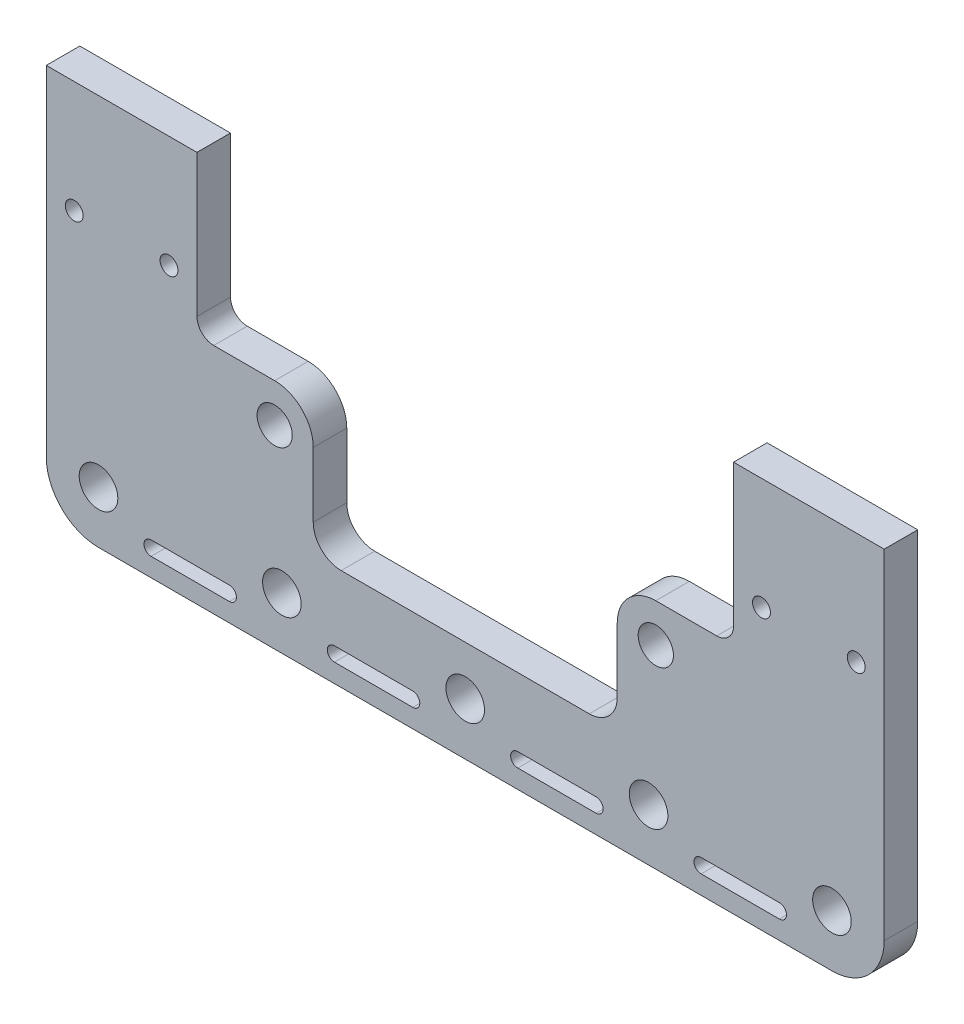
ISO-10303-21;
HEADER;
FILE_DESCRIPTION(('STEP AP214'),'2;1');
FILE_NAME('part.step','',(''),(''),'','','');
FILE_SCHEMA(('AUTOMOTIVE_DESIGN { 1 0 10303 214 1 1 1 1 }'));
ENDSEC;
DATA;
#1=APPLICATION_CONTEXT('core data for automotive mechanical design processes');
#2=APPLICATION_PROTOCOL_DEFINITION('international standard','automotive_design',2000,#1);
#3=PRODUCT_CONTEXT('',#1,'mechanical');
#4=PRODUCT('Part','Part','',(#3));
#5=PRODUCT_RELATED_PRODUCT_CATEGORY('part','',(#4));
#6=PRODUCT_DEFINITION_FORMATION('','',#4);
#7=PRODUCT_DEFINITION_CONTEXT('part definition',#1,'design');
#8=PRODUCT_DEFINITION('design','',#6,#7);
#9=PRODUCT_DEFINITION_SHAPE('','',#8);
#10=(LENGTH_UNIT() NAMED_UNIT(*) SI_UNIT(.MILLI.,.METRE.));
#11=(NAMED_UNIT(*) PLANE_ANGLE_UNIT() SI_UNIT($,.RADIAN.));
#12=(NAMED_UNIT(*) SI_UNIT($,.STERADIAN.) SOLID_ANGLE_UNIT());
#13=UNCERTAINTY_MEASURE_WITH_UNIT(LENGTH_MEASURE(1.E-05),#10,'distance_accuracy_value','');
#14=(GEOMETRIC_REPRESENTATION_CONTEXT(3) GLOBAL_UNCERTAINTY_ASSIGNED_CONTEXT((#13)) GLOBAL_UNIT_ASSIGNED_CONTEXT((#10,
#11,#12)) REPRESENTATION_CONTEXT('',''));
#15=CARTESIAN_POINT('',(0.,0.,0.));
#16=DIRECTION('',(0.,0.,1.));
#17=DIRECTION('',(1.,0.,0.));
#18=AXIS2_PLACEMENT_3D('',#15,#16,#17);
#19=CARTESIAN_POINT('',(-4.04455691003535E-13,204.047118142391,6.));
#20=DIRECTION('',(0.,-1.,0.));
#21=DIRECTION('',(1.,0.,0.));
#22=AXIS2_PLACEMENT_3D('',#19,#20,#21);
#23=PLANE('',#22);
#24=DIRECTION('',(-1.,0.,0.));
#25=VECTOR('',#24,1.);
#26=CARTESIAN_POINT('',(-4.04455691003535E-13,204.047118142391,0.));
#27=LINE('',#26,#25);
#28=CARTESIAN_POINT('',(254.249257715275,204.047118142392,0.));
#29=VERTEX_POINT('',#28);
#30=CARTESIAN_POINT('',(240.246623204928,204.047118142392,0.));
#31=VERTEX_POINT('',#30);
#32=EDGE_CURVE('E427',#29,#31,#27,.T.);
#33=ORIENTED_EDGE('',*,*,#32,.T.);
#34=DIRECTION('',(0.,0.,-1.));
#35=VECTOR('',#34,1.);
#36=CARTESIAN_POINT('',(240.246623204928,204.047118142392,6.));
#37=LINE('',#36,#35);
#38=CARTESIAN_POINT('',(240.246623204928,204.047118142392,6.));
#39=VERTEX_POINT('',#38);
#40=EDGE_CURVE('E11',#39,#31,#37,.T.);
#41=ORIENTED_EDGE('',*,*,#40,.F.);
#42=DIRECTION('',(-1.,0.,0.));
#43=VECTOR('',#42,1.);
#44=CARTESIAN_POINT('',(-4.04455691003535E-13,204.047118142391,6.));
#45=LINE('',#44,#43);
#46=CARTESIAN_POINT('',(254.249257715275,204.047118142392,6.));
#47=VERTEX_POINT('',#46);
#48=EDGE_CURVE('E282',#47,#39,#45,.T.);
#49=ORIENTED_EDGE('',*,*,#48,.F.);
#50=DIRECTION('',(0.,0.,-1.));
#51=VECTOR('',#50,1.);
#52=CARTESIAN_POINT('',(254.249257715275,204.047118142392,6.));
#53=LINE('',#52,#51);
#54=EDGE_CURVE('E435',#47,#29,#53,.T.);
#55=ORIENTED_EDGE('',*,*,#54,.T.);
#56=EDGE_LOOP('',(#33,#41,#49,#55));
#57=FACE_BOUND('',#56,.T.);
#58=ADVANCED_FACE('F36',(#57),#23,.F.);
#59=CARTESIAN_POINT('',(240.246623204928,205.318008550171,6.));
#60=DIRECTION('',(0.,0.,-1.));
#61=DIRECTION('',(-1.,0.,0.));
#62=AXIS2_PLACEMENT_3D('',#59,#60,#61);
#63=CYLINDRICAL_SURFACE('',#62,1.27089040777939);
#64=CARTESIAN_POINT('',(240.246623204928,205.318008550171,0.));
#65=DIRECTION('',(0.,0.,1.));
#66=DIRECTION('',(1.,0.,0.));
#67=AXIS2_PLACEMENT_3D('',#64,#65,#66);
#68=CIRCLE('',#67,1.27089040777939);
#69=CARTESIAN_POINT('',(240.246623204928,206.588898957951,0.));
#70=VERTEX_POINT('',#69);
#71=EDGE_CURVE('E288',#31,#70,#68,.F.);
#72=ORIENTED_EDGE('',*,*,#71,.T.);
#73=DIRECTION('',(0.,0.,-1.));
#74=VECTOR('',#73,1.);
#75=CARTESIAN_POINT('',(240.246623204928,206.588898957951,6.));
#76=LINE('',#75,#74);
#77=CARTESIAN_POINT('',(240.246623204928,206.588898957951,6.));
#78=VERTEX_POINT('',#77);
#79=EDGE_CURVE('E46',#78,#70,#76,.T.);
#80=ORIENTED_EDGE('',*,*,#79,.F.);
#81=CARTESIAN_POINT('',(240.246623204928,205.318008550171,6.));
#82=DIRECTION('',(0.,0.,1.));
#83=DIRECTION('',(1.,0.,0.));
#84=AXIS2_PLACEMENT_3D('',#81,#82,#83);
#85=CIRCLE('',#84,1.27089040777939);
#86=EDGE_CURVE('E276',#39,#78,#85,.F.);
#87=ORIENTED_EDGE('',*,*,#86,.F.);
#88=ORIENTED_EDGE('',*,*,#40,.T.);
#89=EDGE_LOOP('',(#72,#80,#87,#88));
#90=FACE_BOUND('',#89,.T.);
#91=ADVANCED_FACE('F287',(#90),#63,.F.);
#92=CARTESIAN_POINT('',(4.0949392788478E-13,206.588898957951,6.));
#93=DIRECTION('',(0.,-1.,0.));
#94=DIRECTION('',(1.,0.,0.));
#95=AXIS2_PLACEMENT_3D('',#92,#93,#94);
#96=PLANE('',#95);
#97=DIRECTION('',(-1.,0.,0.));
#98=VECTOR('',#97,1.);
#99=CARTESIAN_POINT('',(4.0949392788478E-13,206.588898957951,0.));
#100=LINE('',#99,#98);
#101=CARTESIAN_POINT('',(254.249257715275,206.588898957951,0.));
#102=VERTEX_POINT('',#101);
#103=EDGE_CURVE('E431',#102,#70,#100,.T.);
#104=ORIENTED_EDGE('',*,*,#103,.F.);
#105=DIRECTION('',(0.,0.,-1.));
#106=VECTOR('',#105,1.);
#107=CARTESIAN_POINT('',(254.249257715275,206.588898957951,6.));
#108=LINE('',#107,#106);
#109=CARTESIAN_POINT('',(254.249257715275,206.588898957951,6.));
#110=VERTEX_POINT('',#109);
#111=EDGE_CURVE('E167',#110,#102,#108,.T.);
#112=ORIENTED_EDGE('',*,*,#111,.F.);
#113=DIRECTION('',(-1.,0.,0.));
#114=VECTOR('',#113,1.);
#115=CARTESIAN_POINT('',(4.0949392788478E-13,206.588898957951,6.));
#116=LINE('',#115,#114);
#117=EDGE_CURVE('E280',#110,#78,#116,.T.);
#118=ORIENTED_EDGE('',*,*,#117,.T.);
#119=ORIENTED_EDGE('',*,*,#79,.T.);
#120=EDGE_LOOP('',(#104,#112,#118,#119));
#121=FACE_BOUND('',#120,.T.);
#122=ADVANCED_FACE('F293',(#121),#96,.T.);
#123=CARTESIAN_POINT('',(232.140547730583,235.402023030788,6.));
#124=DIRECTION('',(0.,0.,-1.));
#125=DIRECTION('',(-1.,0.,0.));
#126=AXIS2_PLACEMENT_3D('',#123,#124,#125);
#127=CYLINDRICAL_SURFACE('',#126,6.9);
#128=CARTESIAN_POINT('',(232.140547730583,235.402023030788,0.));
#129=DIRECTION('',(0.,0.,1.));
#130=DIRECTION('',(1.,0.,0.));
#131=AXIS2_PLACEMENT_3D('',#128,#129,#130);
#132=CIRCLE('',#131,6.9);
#133=CARTESIAN_POINT('',(225.240547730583,235.402023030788,0.));
#134=VERTEX_POINT('',#133);
#135=CARTESIAN_POINT('',(232.140547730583,242.302023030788,0.));
#136=VERTEX_POINT('',#135);
#137=EDGE_CURVE('E352',#134,#136,#132,.F.);
#138=ORIENTED_EDGE('',*,*,#137,.F.);
#139=DIRECTION('',(0.,0.,-1.));
#140=VECTOR('',#139,1.);
#141=CARTESIAN_POINT('',(225.240547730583,235.402023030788,6.));
#142=LINE('',#141,#140);
#143=CARTESIAN_POINT('',(225.240547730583,235.402023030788,6.));
#144=VERTEX_POINT('',#143);
#145=EDGE_CURVE('E437',#144,#134,#142,.T.);
#146=ORIENTED_EDGE('',*,*,#145,.F.);
#147=CARTESIAN_POINT('',(232.140547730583,235.402023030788,6.));
#148=DIRECTION('',(0.,0.,1.));
#149=DIRECTION('',(1.,0.,0.));
#150=AXIS2_PLACEMENT_3D('',#147,#148,#149);
#151=CIRCLE('',#150,6.9);
#152=CARTESIAN_POINT('',(232.140547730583,242.302023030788,6.));
#153=VERTEX_POINT('',#152);
#154=EDGE_CURVE('E572',#144,#153,#151,.F.);
#155=ORIENTED_EDGE('',*,*,#154,.T.);
#156=DIRECTION('',(0.,0.,-1.));
#157=VECTOR('',#156,1.);
#158=CARTESIAN_POINT('',(232.140547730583,242.302023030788,6.));
#159=LINE('',#158,#157);
#160=EDGE_CURVE('E439',#153,#136,#159,.T.);
#161=ORIENTED_EDGE('',*,*,#160,.T.);
#162=EDGE_LOOP('',(#138,#146,#155,#161));
#163=FACE_BOUND('',#162,.T.);
#164=ADVANCED_FACE('F768',(#163),#127,.T.);
#165=CARTESIAN_POINT('',(225.240547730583,0.,6.));
#166=DIRECTION('',(1.,0.,0.));
#167=DIRECTION('',(0.,0.,-1.));
#168=AXIS2_PLACEMENT_3D('',#165,#166,#167);
#169=PLANE('',#168);
#170=DIRECTION('',(0.,-1.,0.));
#171=VECTOR('',#170,1.);
#172=CARTESIAN_POINT('',(225.240547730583,0.,0.));
#173=LINE('',#172,#171);
#174=CARTESIAN_POINT('',(225.240547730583,223.837022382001,0.));
#175=VERTEX_POINT('',#174);
#176=EDGE_CURVE('E355',#134,#175,#173,.T.);
#177=ORIENTED_EDGE('',*,*,#176,.T.);
#178=DIRECTION('',(0.,0.,-1.));
#179=VECTOR('',#178,1.);
#180=CARTESIAN_POINT('',(225.240547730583,223.837022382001,6.));
#181=LINE('',#180,#179);
#182=CARTESIAN_POINT('',(225.240547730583,223.837022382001,6.));
#183=VERTEX_POINT('',#182);
#184=EDGE_CURVE('E483',#183,#175,#181,.T.);
#185=ORIENTED_EDGE('',*,*,#184,.F.);
#186=DIRECTION('',(0.,-1.,0.));
#187=VECTOR('',#186,1.);
#188=CARTESIAN_POINT('',(225.240547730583,0.,6.));
#189=LINE('',#188,#187);
#190=EDGE_CURVE('E575',#144,#183,#189,.T.);
#191=ORIENTED_EDGE('',*,*,#190,.F.);
#192=ORIENTED_EDGE('',*,*,#145,.T.);
#193=EDGE_LOOP('',(#177,#185,#191,#192));
#194=FACE_BOUND('',#193,.T.);
#195=ADVANCED_FACE('F764',(#194),#169,.F.);
#196=CARTESIAN_POINT('',(220.240547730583,223.837022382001,6.));
#197=DIRECTION('',(0.,0.,-1.));
#198=DIRECTION('',(-1.,0.,0.));
#199=AXIS2_PLACEMENT_3D('',#196,#197,#198);
#200=CYLINDRICAL_SURFACE('',#199,5.);
#201=CARTESIAN_POINT('',(220.240547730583,223.837022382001,0.));
#202=DIRECTION('',(0.,0.,1.));
#203=DIRECTION('',(1.,0.,0.));
#204=AXIS2_PLACEMENT_3D('',#201,#202,#203);
#205=CIRCLE('',#204,5.);
#206=CARTESIAN_POINT('',(220.240547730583,218.837022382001,0.));
#207=VERTEX_POINT('',#206);
#208=EDGE_CURVE('E358',#207,#175,#205,.T.);
#209=ORIENTED_EDGE('',*,*,#208,.F.);
#210=DIRECTION('',(0.,0.,-1.));
#211=VECTOR('',#210,1.);
#212=CARTESIAN_POINT('',(220.240547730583,218.837022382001,6.));
#213=LINE('',#212,#211);
#214=CARTESIAN_POINT('',(220.240547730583,218.837022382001,6.));
#215=VERTEX_POINT('',#214);
#216=EDGE_CURVE('E481',#215,#207,#213,.T.);
#217=ORIENTED_EDGE('',*,*,#216,.F.);
#218=CARTESIAN_POINT('',(220.240547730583,223.837022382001,6.));
#219=DIRECTION('',(0.,0.,1.));
#220=DIRECTION('',(1.,0.,0.));
#221=AXIS2_PLACEMENT_3D('',#218,#219,#220);
#222=CIRCLE('',#221,5.);
#223=EDGE_CURVE('E577',#215,#183,#222,.T.);
#224=ORIENTED_EDGE('',*,*,#223,.T.);
#225=ORIENTED_EDGE('',*,*,#184,.T.);
#226=EDGE_LOOP('',(#209,#217,#224,#225));
#227=FACE_BOUND('',#226,.T.);
#228=ADVANCED_FACE('F760',(#227),#200,.F.);
#229=CARTESIAN_POINT('',(0.,218.837022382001,6.));
#230=DIRECTION('',(0.,1.,0.));
#231=DIRECTION('',(0.,0.,1.));
#232=AXIS2_PLACEMENT_3D('',#229,#230,#231);
#233=PLANE('',#232);
#234=DIRECTION('',(1.,0.,0.));
#235=VECTOR('',#234,1.);
#236=CARTESIAN_POINT('',(0.,218.837022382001,0.));
#237=LINE('',#236,#235);
#238=CARTESIAN_POINT('',(175.87028017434,218.837022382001,0.));
#239=VERTEX_POINT('',#238);
#240=EDGE_CURVE('E361',#239,#207,#237,.T.);
#241=ORIENTED_EDGE('',*,*,#240,.F.);
#242=DIRECTION('',(0.,0.,-1.));
#243=VECTOR('',#242,1.);
#244=CARTESIAN_POINT('',(175.87028017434,218.837022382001,6.));
#245=LINE('',#244,#243);
#246=CARTESIAN_POINT('',(175.87028017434,218.837022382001,6.));
#247=VERTEX_POINT('',#246);
#248=EDGE_CURVE('E479',#247,#239,#245,.T.);
#249=ORIENTED_EDGE('',*,*,#248,.F.);
#250=DIRECTION('',(1.,0.,0.));
#251=VECTOR('',#250,1.);
#252=CARTESIAN_POINT('',(0.,218.837022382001,6.));
#253=LINE('',#252,#251);
#254=EDGE_CURVE('E580',#247,#215,#253,.T.);
#255=ORIENTED_EDGE('',*,*,#254,.T.);
#256=ORIENTED_EDGE('',*,*,#216,.T.);
#257=EDGE_LOOP('',(#241,#249,#255,#256));
#258=FACE_BOUND('',#257,.T.);
#259=ADVANCED_FACE('F756',(#258),#233,.T.);
#260=CARTESIAN_POINT('',(175.87028017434,223.837022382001,6.));
#261=DIRECTION('',(0.,0.,-1.));
#262=DIRECTION('',(-1.,0.,0.));
#263=AXIS2_PLACEMENT_3D('',#260,#261,#262);
#264=CYLINDRICAL_SURFACE('',#263,5.);
#265=CARTESIAN_POINT('',(175.87028017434,223.837022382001,0.));
#266=DIRECTION('',(0.,0.,1.));
#267=DIRECTION('',(1.,0.,0.));
#268=AXIS2_PLACEMENT_3D('',#265,#266,#267);
#269=CIRCLE('',#268,5.);
#270=CARTESIAN_POINT('',(170.87028017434,223.837022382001,0.));
#271=VERTEX_POINT('',#270);
#272=EDGE_CURVE('E364',#239,#271,#269,.F.);
#273=ORIENTED_EDGE('',*,*,#272,.T.);
#274=DIRECTION('',(0.,0.,-1.));
#275=VECTOR('',#274,1.);
#276=CARTESIAN_POINT('',(170.87028017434,223.837022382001,6.));
#277=LINE('',#276,#275);
#278=CARTESIAN_POINT('',(170.87028017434,223.837022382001,6.));
#279=VERTEX_POINT('',#278);
#280=EDGE_CURVE('E477',#279,#271,#277,.T.);
#281=ORIENTED_EDGE('',*,*,#280,.F.);
#282=CARTESIAN_POINT('',(175.87028017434,223.837022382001,6.));
#283=DIRECTION('',(0.,0.,1.));
#284=DIRECTION('',(1.,0.,0.));
#285=AXIS2_PLACEMENT_3D('',#282,#283,#284);
#286=CIRCLE('',#285,5.);
#287=EDGE_CURVE('E583',#247,#279,#286,.F.);
#288=ORIENTED_EDGE('',*,*,#287,.F.);
#289=ORIENTED_EDGE('',*,*,#248,.T.);
#290=EDGE_LOOP('',(#273,#281,#288,#289));
#291=FACE_BOUND('',#290,.T.);
#292=ADVANCED_FACE('F752',(#291),#264,.F.);
#293=CARTESIAN_POINT('',(170.87028017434,0.,6.));
#294=DIRECTION('',(1.,0.,0.));
#295=DIRECTION('',(0.,0.,-1.));
#296=AXIS2_PLACEMENT_3D('',#293,#294,#295);
#297=PLANE('',#296);
#298=DIRECTION('',(0.,-1.,0.));
#299=VECTOR('',#298,1.);
#300=CARTESIAN_POINT('',(170.87028017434,0.,0.));
#301=LINE('',#300,#299);
#302=CARTESIAN_POINT('',(170.87028017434,235.402023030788,0.));
#303=VERTEX_POINT('',#302);
#304=EDGE_CURVE('E367',#303,#271,#301,.T.);
#305=ORIENTED_EDGE('',*,*,#304,.F.);
#306=DIRECTION('',(0.,0.,-1.));
#307=VECTOR('',#306,1.);
#308=CARTESIAN_POINT('',(170.87028017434,235.402023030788,6.));
#309=LINE('',#308,#307);
#310=CARTESIAN_POINT('',(170.87028017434,235.402023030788,6.));
#311=VERTEX_POINT('',#310);
#312=EDGE_CURVE('E475',#311,#303,#309,.T.);
#313=ORIENTED_EDGE('',*,*,#312,.F.);
#314=DIRECTION('',(0.,-1.,0.));
#315=VECTOR('',#314,1.);
#316=CARTESIAN_POINT('',(170.87028017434,0.,6.));
#317=LINE('',#316,#315);
#318=EDGE_CURVE('E585',#311,#279,#317,.T.);
#319=ORIENTED_EDGE('',*,*,#318,.T.);
#320=ORIENTED_EDGE('',*,*,#280,.T.);
#321=EDGE_LOOP('',(#305,#313,#319,#320));
#322=FACE_BOUND('',#321,.T.);
#323=ADVANCED_FACE('F748',(#322),#297,.T.);
#324=CARTESIAN_POINT('',(163.97028017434,235.402023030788,6.));
#325=DIRECTION('',(0.,0.,-1.));
#326=DIRECTION('',(-1.,0.,0.));
#327=AXIS2_PLACEMENT_3D('',#324,#325,#326);
#328=CYLINDRICAL_SURFACE('',#327,6.89999999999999);
#329=CARTESIAN_POINT('',(163.97028017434,235.402023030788,0.));
#330=DIRECTION('',(0.,0.,1.));
#331=DIRECTION('',(1.,0.,0.));
#332=AXIS2_PLACEMENT_3D('',#329,#330,#331);
#333=CIRCLE('',#332,6.89999999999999);
#334=CARTESIAN_POINT('',(163.97028017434,242.302023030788,0.));
#335=VERTEX_POINT('',#334);
#336=EDGE_CURVE('E370',#303,#335,#333,.T.);
#337=ORIENTED_EDGE('',*,*,#336,.T.);
#338=DIRECTION('',(0.,0.,-1.));
#339=VECTOR('',#338,1.);
#340=CARTESIAN_POINT('',(163.97028017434,242.302023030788,6.));
#341=LINE('',#340,#339);
#342=CARTESIAN_POINT('',(163.97028017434,242.302023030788,6.));
#343=VERTEX_POINT('',#342);
#344=EDGE_CURVE('E472',#343,#335,#341,.T.);
#345=ORIENTED_EDGE('',*,*,#344,.F.);
#346=CARTESIAN_POINT('',(163.97028017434,235.402023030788,6.));
#347=DIRECTION('',(0.,0.,1.));
#348=DIRECTION('',(1.,0.,0.));
#349=AXIS2_PLACEMENT_3D('',#346,#347,#348);
#350=CIRCLE('',#349,6.89999999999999);
#351=EDGE_CURVE('E588',#311,#343,#350,.T.);
#352=ORIENTED_EDGE('',*,*,#351,.F.);
#353=ORIENTED_EDGE('',*,*,#312,.T.);
#354=EDGE_LOOP('',(#337,#345,#352,#353));
#355=FACE_BOUND('',#354,.T.);
#356=ADVANCED_FACE('F744',(#355),#328,.T.);
#357=CARTESIAN_POINT('',(0.,242.302023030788,6.));
#358=DIRECTION('',(0.,-1.,0.));
#359=DIRECTION('',(0.,0.,-1.));
#360=AXIS2_PLACEMENT_3D('',#357,#358,#359);
#361=PLANE('',#360);
#362=DIRECTION('',(-1.,0.,0.));
#363=VECTOR('',#362,1.);
#364=CARTESIAN_POINT('',(0.,242.302023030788,0.));
#365=LINE('',#364,#363);
#366=CARTESIAN_POINT('',(153.070412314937,242.302023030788,0.));
#367=VERTEX_POINT('',#366);
#368=EDGE_CURVE('E373',#335,#367,#365,.T.);
#369=ORIENTED_EDGE('',*,*,#368,.T.);
#370=DIRECTION('',(0.,0.,-1.));
#371=VECTOR('',#370,1.);
#372=CARTESIAN_POINT('',(153.070412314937,242.302023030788,6.));
#373=LINE('',#372,#371);
#374=CARTESIAN_POINT('',(153.070412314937,242.302023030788,6.));
#375=VERTEX_POINT('',#374);
#376=EDGE_CURVE('E469',#375,#367,#373,.T.);
#377=ORIENTED_EDGE('',*,*,#376,.F.);
#378=DIRECTION('',(-1.,0.,0.));
#379=VECTOR('',#378,1.);
#380=CARTESIAN_POINT('',(0.,242.302023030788,6.));
#381=LINE('',#380,#379);
#382=EDGE_CURVE('E591',#343,#375,#381,.T.);
#383=ORIENTED_EDGE('',*,*,#382,.F.);
#384=ORIENTED_EDGE('',*,*,#344,.T.);
#385=EDGE_LOOP('',(#369,#377,#383,#384));
#386=FACE_BOUND('',#385,.T.);
#387=ADVANCED_FACE('F740',(#386),#361,.F.);
#388=CARTESIAN_POINT('',(153.070412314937,245.302023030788,6.));
#389=DIRECTION('',(0.,0.,-1.));
#390=DIRECTION('',(-1.,0.,0.));
#391=AXIS2_PLACEMENT_3D('',#388,#389,#390);
#392=CYLINDRICAL_SURFACE('',#391,3.);
#393=CARTESIAN_POINT('',(153.070412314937,245.302023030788,0.));
#394=DIRECTION('',(0.,0.,1.));
#395=DIRECTION('',(1.,0.,0.));
#396=AXIS2_PLACEMENT_3D('',#393,#394,#395);
#397=CIRCLE('',#396,3.);
#398=CARTESIAN_POINT('',(150.070412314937,245.302023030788,0.));
#399=VERTEX_POINT('',#398);
#400=EDGE_CURVE('E376',#367,#399,#397,.F.);
#401=ORIENTED_EDGE('',*,*,#400,.T.);
#402=DIRECTION('',(0.,0.,-1.));
#403=VECTOR('',#402,1.);
#404=CARTESIAN_POINT('',(150.070412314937,245.302023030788,6.));
#405=LINE('',#404,#403);
#406=CARTESIAN_POINT('',(150.070412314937,245.302023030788,6.));
#407=VERTEX_POINT('',#406);
#408=EDGE_CURVE('E466',#407,#399,#405,.T.);
#409=ORIENTED_EDGE('',*,*,#408,.F.);
#410=CARTESIAN_POINT('',(153.070412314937,245.302023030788,6.));
#411=DIRECTION('',(0.,0.,1.));
#412=DIRECTION('',(1.,0.,0.));
#413=AXIS2_PLACEMENT_3D('',#410,#411,#412);
#414=CIRCLE('',#413,3.);
#415=EDGE_CURVE('E594',#375,#407,#414,.F.);
#416=ORIENTED_EDGE('',*,*,#415,.F.);
#417=ORIENTED_EDGE('',*,*,#376,.T.);
#418=EDGE_LOOP('',(#401,#409,#416,#417));
#419=FACE_BOUND('',#418,.T.);
#420=ADVANCED_FACE('F736',(#419),#392,.F.);
#421=CARTESIAN_POINT('',(150.070412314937,0.,6.));
#422=DIRECTION('',(-1.,0.,0.));
#423=DIRECTION('',(0.,0.,1.));
#424=AXIS2_PLACEMENT_3D('',#421,#422,#423);
#425=PLANE('',#424);
#426=DIRECTION('',(0.,1.,0.));
#427=VECTOR('',#426,1.);
#428=CARTESIAN_POINT('',(150.070412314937,0.,0.));
#429=LINE('',#428,#427);
#430=CARTESIAN_POINT('',(150.070412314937,270.717205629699,0.));
#431=VERTEX_POINT('',#430);
#432=EDGE_CURVE('E379',#399,#431,#429,.T.);
#433=ORIENTED_EDGE('',*,*,#432,.T.);
#434=DIRECTION('',(0.,0.,-1.));
#435=VECTOR('',#434,1.);
#436=CARTESIAN_POINT('',(150.070412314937,270.717205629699,6.));
#437=LINE('',#436,#435);
#438=CARTESIAN_POINT('',(150.070412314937,270.717205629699,6.));
#439=VERTEX_POINT('',#438);
#440=EDGE_CURVE('E463',#439,#431,#437,.T.);
#441=ORIENTED_EDGE('',*,*,#440,.F.);
#442=DIRECTION('',(0.,1.,0.));
#443=VECTOR('',#442,1.);
#444=CARTESIAN_POINT('',(150.070412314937,0.,6.));
#445=LINE('',#444,#443);
#446=EDGE_CURVE('E597',#407,#439,#445,.T.);
#447=ORIENTED_EDGE('',*,*,#446,.F.);
#448=ORIENTED_EDGE('',*,*,#408,.T.);
#449=EDGE_LOOP('',(#433,#441,#447,#448));
#450=FACE_BOUND('',#449,.T.);
#451=ADVANCED_FACE('F732',(#450),#425,.F.);
#452=CARTESIAN_POINT('',(-5.5761869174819E-13,270.717205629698,6.));
#453=DIRECTION('',(0.,-1.,0.));
#454=DIRECTION('',(1.,0.,0.));
#455=AXIS2_PLACEMENT_3D('',#452,#453,#454);
#456=PLANE('',#455);
#457=DIRECTION('',(-1.,0.,0.));
#458=VECTOR('',#457,1.);
#459=CARTESIAN_POINT('',(-5.5761869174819E-13,270.717205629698,0.));
#460=LINE('',#459,#458);
#461=CARTESIAN_POINT('',(123.120412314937,270.717205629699,0.));
#462=VERTEX_POINT('',#461);
#463=EDGE_CURVE('E382',#431,#462,#460,.T.);
#464=ORIENTED_EDGE('',*,*,#463,.T.);
#465=DIRECTION('',(0.,0.,-1.));
#466=VECTOR('',#465,1.);
#467=CARTESIAN_POINT('',(123.120412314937,270.717205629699,6.));
#468=LINE('',#467,#466);
#469=CARTESIAN_POINT('',(123.120412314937,270.717205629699,6.));
#470=VERTEX_POINT('',#469);
#471=EDGE_CURVE('E460',#470,#462,#468,.T.);
#472=ORIENTED_EDGE('',*,*,#471,.F.);
#473=DIRECTION('',(-1.,0.,0.));
#474=VECTOR('',#473,1.);
#475=CARTESIAN_POINT('',(-5.5761869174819E-13,270.717205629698,6.));
#476=LINE('',#475,#474);
#477=EDGE_CURVE('E600',#439,#470,#476,.T.);
#478=ORIENTED_EDGE('',*,*,#477,.F.);
#479=ORIENTED_EDGE('',*,*,#440,.T.);
#480=EDGE_LOOP('',(#464,#472,#478,#479));
#481=FACE_BOUND('',#480,.T.);
#482=ADVANCED_FACE('F728',(#481),#456,.F.);
#483=CARTESIAN_POINT('',(123.120412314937,0.,6.));
#484=DIRECTION('',(1.,0.,0.));
#485=DIRECTION('',(0.,1.,0.));
#486=AXIS2_PLACEMENT_3D('',#483,#484,#485);
#487=PLANE('',#486);
#488=DIRECTION('',(0.,-1.,0.));
#489=VECTOR('',#488,1.);
#490=CARTESIAN_POINT('',(123.120412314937,0.,0.));
#491=LINE('',#490,#489);
#492=CARTESIAN_POINT('',(123.120412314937,210.062171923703,0.));
#493=VERTEX_POINT('',#492);
#494=EDGE_CURVE('E385',#462,#493,#491,.T.);
#495=ORIENTED_EDGE('',*,*,#494,.T.);
#496=DIRECTION('',(0.,0.,-1.));
#497=VECTOR('',#496,1.);
#498=CARTESIAN_POINT('',(123.120412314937,210.062171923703,6.));
#499=LINE('',#498,#497);
#500=CARTESIAN_POINT('',(123.120412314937,210.062171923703,6.));
#501=VERTEX_POINT('',#500);
#502=EDGE_CURVE('E457',#501,#493,#499,.T.);
#503=ORIENTED_EDGE('',*,*,#502,.F.);
#504=DIRECTION('',(0.,-1.,0.));
#505=VECTOR('',#504,1.);
#506=CARTESIAN_POINT('',(123.120412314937,0.,6.));
#507=LINE('',#506,#505);
#508=EDGE_CURVE('E603',#470,#501,#507,.T.);
#509=ORIENTED_EDGE('',*,*,#508,.F.);
#510=ORIENTED_EDGE('',*,*,#471,.T.);
#511=EDGE_LOOP('',(#495,#503,#509,#510));
#512=FACE_BOUND('',#511,.T.);
#513=ADVANCED_FACE('F724',(#512),#487,.F.);
#514=CARTESIAN_POINT('',(132.465378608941,210.062171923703,6.));
#515=DIRECTION('',(0.,0.,-1.));
#516=DIRECTION('',(-1.,0.,0.));
#517=AXIS2_PLACEMENT_3D('',#514,#515,#516);
#518=CYLINDRICAL_SURFACE('',#517,9.34496629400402);
#519=CARTESIAN_POINT('',(132.465378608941,210.062171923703,0.));
#520=DIRECTION('',(0.,0.,1.));
#521=DIRECTION('',(1.,0.,0.));
#522=AXIS2_PLACEMENT_3D('',#519,#520,#521);
#523=CIRCLE('',#522,9.34496629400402);
#524=CARTESIAN_POINT('',(132.465378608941,200.717205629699,0.));
#525=VERTEX_POINT('',#524);
#526=EDGE_CURVE('E388',#493,#525,#523,.T.);
#527=ORIENTED_EDGE('',*,*,#526,.T.);
#528=DIRECTION('',(0.,0.,-1.));
#529=VECTOR('',#528,1.);
#530=CARTESIAN_POINT('',(132.465378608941,200.717205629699,6.));
#531=LINE('',#530,#529);
#532=CARTESIAN_POINT('',(132.465378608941,200.717205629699,6.));
#533=VERTEX_POINT('',#532);
#534=EDGE_CURVE('E454',#533,#525,#531,.T.);
#535=ORIENTED_EDGE('',*,*,#534,.F.);
#536=CARTESIAN_POINT('',(132.465378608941,210.062171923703,6.));
#537=DIRECTION('',(0.,0.,1.));
#538=DIRECTION('',(1.,0.,0.));
#539=AXIS2_PLACEMENT_3D('',#536,#537,#538);
#540=CIRCLE('',#539,9.34496629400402);
#541=EDGE_CURVE('E606',#501,#533,#540,.T.);
#542=ORIENTED_EDGE('',*,*,#541,.F.);
#543=ORIENTED_EDGE('',*,*,#502,.T.);
#544=EDGE_LOOP('',(#527,#535,#542,#543));
#545=FACE_BOUND('',#544,.T.);
#546=ADVANCED_FACE('F720',(#545),#518,.T.);
#547=CARTESIAN_POINT('',(0.,200.717205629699,6.));
#548=DIRECTION('',(0.,1.,0.));
#549=DIRECTION('',(0.,0.,1.));
#550=AXIS2_PLACEMENT_3D('',#547,#548,#549);
#551=PLANE('',#550);
#552=DIRECTION('',(1.,0.,0.));
#553=VECTOR('',#552,1.);
#554=CARTESIAN_POINT('',(0.,200.717205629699,0.));
#555=LINE('',#554,#553);
#556=CARTESIAN_POINT('',(263.645449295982,200.717205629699,0.));
#557=VERTEX_POINT('',#556);
#558=EDGE_CURVE('E391',#525,#557,#555,.T.);
#559=ORIENTED_EDGE('',*,*,#558,.T.);
#560=DIRECTION('',(0.,0.,-1.));
#561=VECTOR('',#560,1.);
#562=CARTESIAN_POINT('',(263.645449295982,200.717205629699,6.));
#563=LINE('',#562,#561);
#564=CARTESIAN_POINT('',(263.645449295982,200.717205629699,6.));
#565=VERTEX_POINT('',#564);
#566=EDGE_CURVE('E452',#565,#557,#563,.T.);
#567=ORIENTED_EDGE('',*,*,#566,.F.);
#568=DIRECTION('',(1.,0.,0.));
#569=VECTOR('',#568,1.);
#570=CARTESIAN_POINT('',(0.,200.717205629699,6.));
#571=LINE('',#570,#569);
#572=EDGE_CURVE('E609',#533,#565,#571,.T.);
#573=ORIENTED_EDGE('',*,*,#572,.F.);
#574=ORIENTED_EDGE('',*,*,#534,.T.);
#575=EDGE_LOOP('',(#559,#567,#573,#574));
#576=FACE_BOUND('',#575,.T.);
#577=ADVANCED_FACE('F716',(#576),#551,.F.);
#578=CARTESIAN_POINT('',(263.645449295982,210.062171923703,6.));
#579=DIRECTION('',(0.,0.,-1.));
#580=DIRECTION('',(-1.,0.,0.));
#581=AXIS2_PLACEMENT_3D('',#578,#579,#580);
#582=CYLINDRICAL_SURFACE('',#581,9.34496629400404);
#583=CARTESIAN_POINT('',(263.645449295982,210.062171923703,0.));
#584=DIRECTION('',(0.,0.,1.));
#585=DIRECTION('',(1.,0.,0.));
#586=AXIS2_PLACEMENT_3D('',#583,#584,#585);
#587=CIRCLE('',#586,9.34496629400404);
#588=CARTESIAN_POINT('',(272.990415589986,210.062171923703,0.));
#589=VERTEX_POINT('',#588);
#590=EDGE_CURVE('E394',#589,#557,#587,.F.);
#591=ORIENTED_EDGE('',*,*,#590,.F.);
#592=DIRECTION('',(0.,0.,-1.));
#593=VECTOR('',#592,1.);
#594=CARTESIAN_POINT('',(272.990415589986,210.062171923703,6.));
#595=LINE('',#594,#593);
#596=CARTESIAN_POINT('',(272.990415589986,210.062171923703,6.));
#597=VERTEX_POINT('',#596);
#598=EDGE_CURVE('E450',#597,#589,#595,.T.);
#599=ORIENTED_EDGE('',*,*,#598,.F.);
#600=CARTESIAN_POINT('',(263.645449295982,210.062171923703,6.));
#601=DIRECTION('',(0.,0.,1.));
#602=DIRECTION('',(1.,0.,0.));
#603=AXIS2_PLACEMENT_3D('',#600,#601,#602);
#604=CIRCLE('',#603,9.34496629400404);
#605=EDGE_CURVE('E611',#597,#565,#604,.F.);
#606=ORIENTED_EDGE('',*,*,#605,.T.);
#607=ORIENTED_EDGE('',*,*,#566,.T.);
#608=EDGE_LOOP('',(#591,#599,#606,#607));
#609=FACE_BOUND('',#608,.T.);
#610=ADVANCED_FACE('F712',(#609),#582,.T.);
#611=CARTESIAN_POINT('',(272.990415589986,2.4983931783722E-13,6.));
#612=DIRECTION('',(1.,0.,0.));
#613=DIRECTION('',(0.,1.,0.));
#614=AXIS2_PLACEMENT_3D('',#611,#612,#613);
#615=PLANE('',#614);
#616=DIRECTION('',(0.,-1.,0.));
#617=VECTOR('',#616,1.);
#618=CARTESIAN_POINT('',(272.990415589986,2.4983931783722E-13,0.));
#619=LINE('',#618,#617);
#620=CARTESIAN_POINT('',(272.990415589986,270.717205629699,0.));
#621=VERTEX_POINT('',#620);
#622=EDGE_CURVE('E397',#621,#589,#619,.T.);
#623=ORIENTED_EDGE('',*,*,#622,.F.);
#624=DIRECTION('',(0.,0.,-1.));
#625=VECTOR('',#624,1.);
#626=CARTESIAN_POINT('',(272.990415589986,270.717205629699,6.));
#627=LINE('',#626,#625);
#628=CARTESIAN_POINT('',(272.990415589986,270.717205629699,6.));
#629=VERTEX_POINT('',#628);
#630=EDGE_CURVE('E448',#629,#621,#627,.T.);
#631=ORIENTED_EDGE('',*,*,#630,.F.);
#632=DIRECTION('',(0.,-1.,0.));
#633=VECTOR('',#632,1.);
#634=CARTESIAN_POINT('',(272.990415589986,2.4983931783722E-13,6.));
#635=LINE('',#634,#633);
#636=EDGE_CURVE('E614',#629,#597,#635,.T.);
#637=ORIENTED_EDGE('',*,*,#636,.T.);
#638=ORIENTED_EDGE('',*,*,#598,.T.);
#639=EDGE_LOOP('',(#623,#631,#637,#638));
#640=FACE_BOUND('',#639,.T.);
#641=ADVANCED_FACE('F708',(#640),#615,.T.);
#642=CARTESIAN_POINT('',(5.57618691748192E-13,270.717205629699,6.));
#643=DIRECTION('',(0.,1.,0.));
#644=DIRECTION('',(-1.,0.,0.));
#645=AXIS2_PLACEMENT_3D('',#642,#643,#644);
#646=PLANE('',#645);
#647=DIRECTION('',(1.,0.,0.));
#648=VECTOR('',#647,1.);
#649=CARTESIAN_POINT('',(5.57618691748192E-13,270.717205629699,0.));
#650=LINE('',#649,#648);
#651=CARTESIAN_POINT('',(246.040415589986,270.717205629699,0.));
#652=VERTEX_POINT('',#651);
#653=EDGE_CURVE('E400',#652,#621,#650,.T.);
#654=ORIENTED_EDGE('',*,*,#653,.F.);
#655=DIRECTION('',(0.,0.,-1.));
#656=VECTOR('',#655,1.);
#657=CARTESIAN_POINT('',(246.040415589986,270.717205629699,6.));
#658=LINE('',#657,#656);
#659=CARTESIAN_POINT('',(246.040415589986,270.717205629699,6.));
#660=VERTEX_POINT('',#659);
#661=EDGE_CURVE('E446',#660,#652,#658,.T.);
#662=ORIENTED_EDGE('',*,*,#661,.F.);
#663=DIRECTION('',(1.,0.,0.));
#664=VECTOR('',#663,1.);
#665=CARTESIAN_POINT('',(5.57618691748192E-13,270.717205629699,6.));
#666=LINE('',#665,#664);
#667=EDGE_CURVE('E617',#660,#629,#666,.T.);
#668=ORIENTED_EDGE('',*,*,#667,.T.);
#669=ORIENTED_EDGE('',*,*,#630,.T.);
#670=EDGE_LOOP('',(#654,#662,#668,#669));
#671=FACE_BOUND('',#670,.T.);
#672=ADVANCED_FACE('F704',(#671),#646,.T.);
#673=CARTESIAN_POINT('',(246.040415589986,-2.68697395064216E-13,6.));
#674=DIRECTION('',(-1.,0.,0.));
#675=DIRECTION('',(0.,-1.,0.));
#676=AXIS2_PLACEMENT_3D('',#673,#674,#675);
#677=PLANE('',#676);
#678=DIRECTION('',(0.,1.,0.));
#679=VECTOR('',#678,1.);
#680=CARTESIAN_POINT('',(246.040415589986,-2.68697395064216E-13,0.));
#681=LINE('',#680,#679);
#682=CARTESIAN_POINT('',(246.040415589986,245.302023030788,0.));
#683=VERTEX_POINT('',#682);
#684=EDGE_CURVE('E403',#683,#652,#681,.T.);
#685=ORIENTED_EDGE('',*,*,#684,.F.);
#686=DIRECTION('',(0.,0.,-1.));
#687=VECTOR('',#686,1.);
#688=CARTESIAN_POINT('',(246.040415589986,245.302023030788,6.));
#689=LINE('',#688,#687);
#690=CARTESIAN_POINT('',(246.040415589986,245.302023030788,6.));
#691=VERTEX_POINT('',#690);
#692=EDGE_CURVE('E444',#691,#683,#689,.T.);
#693=ORIENTED_EDGE('',*,*,#692,.F.);
#694=DIRECTION('',(0.,1.,0.));
#695=VECTOR('',#694,1.);
#696=CARTESIAN_POINT('',(246.040415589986,-2.68697395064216E-13,6.));
#697=LINE('',#696,#695);
#698=EDGE_CURVE('E620',#691,#660,#697,.T.);
#699=ORIENTED_EDGE('',*,*,#698,.T.);
#700=ORIENTED_EDGE('',*,*,#661,.T.);
#701=EDGE_LOOP('',(#685,#693,#699,#700));
#702=FACE_BOUND('',#701,.T.);
#703=ADVANCED_FACE('F700',(#702),#677,.T.);
#704=CARTESIAN_POINT('',(243.040415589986,245.302023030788,6.));
#705=DIRECTION('',(0.,0.,-1.));
#706=DIRECTION('',(-1.,0.,0.));
#707=AXIS2_PLACEMENT_3D('',#704,#705,#706);
#708=CYLINDRICAL_SURFACE('',#707,3.);
#709=CARTESIAN_POINT('',(243.040415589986,245.302023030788,0.));
#710=DIRECTION('',(0.,0.,1.));
#711=DIRECTION('',(1.,0.,0.));
#712=AXIS2_PLACEMENT_3D('',#709,#710,#711);
#713=CIRCLE('',#712,3.);
#714=CARTESIAN_POINT('',(243.040415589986,242.302023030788,0.));
#715=VERTEX_POINT('',#714);
#716=EDGE_CURVE('E406',#715,#683,#713,.T.);
#717=ORIENTED_EDGE('',*,*,#716,.F.);
#718=DIRECTION('',(0.,0.,-1.));
#719=VECTOR('',#718,1.);
#720=CARTESIAN_POINT('',(243.040415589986,242.302023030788,6.));
#721=LINE('',#720,#719);
#722=CARTESIAN_POINT('',(243.040415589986,242.302023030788,6.));
#723=VERTEX_POINT('',#722);
#724=EDGE_CURVE('E441',#723,#715,#721,.T.);
#725=ORIENTED_EDGE('',*,*,#724,.F.);
#726=CARTESIAN_POINT('',(243.040415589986,245.302023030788,6.));
#727=DIRECTION('',(0.,0.,1.));
#728=DIRECTION('',(1.,0.,0.));
#729=AXIS2_PLACEMENT_3D('',#726,#727,#728);
#730=CIRCLE('',#729,3.);
#731=EDGE_CURVE('E623',#723,#691,#730,.T.);
#732=ORIENTED_EDGE('',*,*,#731,.T.);
#733=ORIENTED_EDGE('',*,*,#692,.T.);
#734=EDGE_LOOP('',(#717,#725,#732,#733));
#735=FACE_BOUND('',#734,.T.);
#736=ADVANCED_FACE('F696',(#735),#708,.F.);
#737=CARTESIAN_POINT('',(155.864204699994,205.318008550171,6.));
#738=DIRECTION('',(0.,0.,-1.));
#739=DIRECTION('',(-1.,0.,0.));
#740=AXIS2_PLACEMENT_3D('',#737,#738,#739);
#741=CYLINDRICAL_SURFACE('',#740,1.27089040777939);
#742=CARTESIAN_POINT('',(155.864204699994,205.318008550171,0.));
#743=DIRECTION('',(0.,0.,1.));
#744=DIRECTION('',(1.,0.,0.));
#745=AXIS2_PLACEMENT_3D('',#742,#743,#744);
#746=CIRCLE('',#745,1.27089040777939);
#747=CARTESIAN_POINT('',(155.864204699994,204.047118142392,0.));
#748=VERTEX_POINT('',#747);
#749=CARTESIAN_POINT('',(155.864204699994,206.588898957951,0.));
#750=VERTEX_POINT('',#749);
#751=EDGE_CURVE('E322',#748,#750,#746,.T.);
#752=ORIENTED_EDGE('',*,*,#751,.F.);
#753=DIRECTION('',(0.,0.,-1.));
#754=VECTOR('',#753,1.);
#755=CARTESIAN_POINT('',(155.864204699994,204.047118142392,6.));
#756=LINE('',#755,#754);
#757=CARTESIAN_POINT('',(155.864204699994,204.047118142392,6.));
#758=VERTEX_POINT('',#757);
#759=EDGE_CURVE('E442',#758,#748,#756,.T.);
#760=ORIENTED_EDGE('',*,*,#759,.F.);
#761=CARTESIAN_POINT('',(155.864204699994,205.318008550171,6.));
#762=DIRECTION('',(0.,0.,1.));
#763=DIRECTION('',(1.,0.,0.));
#764=AXIS2_PLACEMENT_3D('',#761,#762,#763);
#765=CIRCLE('',#764,1.27089040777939);
#766=CARTESIAN_POINT('',(155.864204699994,206.588898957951,6.));
#767=VERTEX_POINT('',#766);
#768=EDGE_CURVE('E543',#758,#767,#765,.T.);
#769=ORIENTED_EDGE('',*,*,#768,.T.);
#770=DIRECTION('',(0.,0.,-1.));
#771=VECTOR('',#770,1.);
#772=CARTESIAN_POINT('',(155.864204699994,206.588898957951,6.));
#773=LINE('',#772,#771);
#774=EDGE_CURVE('E486',#767,#750,#773,.T.);
#775=ORIENTED_EDGE('',*,*,#774,.T.);
#776=EDGE_LOOP('',(#752,#760,#769,#775));
#777=FACE_BOUND('',#776,.T.);
#778=ADVANCED_FACE('F699',(#777),#741,.F.);
#779=CARTESIAN_POINT('',(4.04455691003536E-13,204.047118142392,6.));
#780=DIRECTION('',(0.,1.,0.));
#781=DIRECTION('',(-1.,0.,0.));
#782=AXIS2_PLACEMENT_3D('',#779,#780,#781);
#783=PLANE('',#782);
#784=DIRECTION('',(1.,0.,0.));
#785=VECTOR('',#784,1.);
#786=CARTESIAN_POINT('',(4.04455691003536E-13,204.047118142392,0.));
#787=LINE('',#786,#785);
#788=CARTESIAN_POINT('',(141.861570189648,204.047118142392,0.));
#789=VERTEX_POINT('',#788);
#790=EDGE_CURVE('E325',#789,#748,#787,.T.);
#791=ORIENTED_EDGE('',*,*,#790,.F.);
#792=DIRECTION('',(0.,0.,-1.));
#793=VECTOR('',#792,1.);
#794=CARTESIAN_POINT('',(141.861570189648,204.047118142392,6.));
#795=LINE('',#794,#793);
#796=CARTESIAN_POINT('',(141.861570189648,204.047118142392,6.));
#797=VERTEX_POINT('',#796);
#798=EDGE_CURVE('E491',#797,#789,#795,.T.);
#799=ORIENTED_EDGE('',*,*,#798,.F.);
#800=DIRECTION('',(1.,0.,0.));
#801=VECTOR('',#800,1.);
#802=CARTESIAN_POINT('',(4.04455691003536E-13,204.047118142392,6.));
#803=LINE('',#802,#801);
#804=EDGE_CURVE('E546',#797,#758,#803,.T.);
#805=ORIENTED_EDGE('',*,*,#804,.T.);
#806=ORIENTED_EDGE('',*,*,#759,.T.);
#807=EDGE_LOOP('',(#791,#799,#805,#806));
#808=FACE_BOUND('',#807,.T.);
#809=ADVANCED_FACE('F804',(#808),#783,.T.);
#810=CARTESIAN_POINT('',(141.861570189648,205.318008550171,6.));
#811=DIRECTION('',(0.,0.,-1.));
#812=DIRECTION('',(-1.,0.,0.));
#813=AXIS2_PLACEMENT_3D('',#810,#811,#812);
#814=CYLINDRICAL_SURFACE('',#813,1.27089040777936);
#815=CARTESIAN_POINT('',(141.861570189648,205.318008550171,0.));
#816=DIRECTION('',(0.,0.,1.));
#817=DIRECTION('',(1.,0.,0.));
#818=AXIS2_PLACEMENT_3D('',#815,#816,#817);
#819=CIRCLE('',#818,1.27089040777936);
#820=CARTESIAN_POINT('',(141.861570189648,206.588898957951,0.));
#821=VERTEX_POINT('',#820);
#822=EDGE_CURVE('E328',#821,#789,#819,.T.);
#823=ORIENTED_EDGE('',*,*,#822,.F.);
#824=DIRECTION('',(0.,0.,-1.));
#825=VECTOR('',#824,1.);
#826=CARTESIAN_POINT('',(141.861570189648,206.588898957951,6.));
#827=LINE('',#826,#825);
#828=CARTESIAN_POINT('',(141.861570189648,206.588898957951,6.));
#829=VERTEX_POINT('',#828);
#830=EDGE_CURVE('E488',#829,#821,#827,.T.);
#831=ORIENTED_EDGE('',*,*,#830,.F.);
#832=CARTESIAN_POINT('',(141.861570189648,205.318008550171,6.));
#833=DIRECTION('',(0.,0.,1.));
#834=DIRECTION('',(1.,0.,0.));
#835=AXIS2_PLACEMENT_3D('',#832,#833,#834);
#836=CIRCLE('',#835,1.27089040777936);
#837=EDGE_CURVE('E549',#829,#797,#836,.T.);
#838=ORIENTED_EDGE('',*,*,#837,.T.);
#839=ORIENTED_EDGE('',*,*,#798,.T.);
#840=EDGE_LOOP('',(#823,#831,#838,#839));
#841=FACE_BOUND('',#840,.T.);
#842=ADVANCED_FACE('F800',(#841),#814,.F.);
#843=CARTESIAN_POINT('',(188.659222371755,205.318008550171,6.));
#844=DIRECTION('',(0.,0.,-1.));
#845=DIRECTION('',(-1.,0.,0.));
#846=AXIS2_PLACEMENT_3D('',#843,#844,#845);
#847=CYLINDRICAL_SURFACE('',#846,1.27089040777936);
#848=CARTESIAN_POINT('',(188.659222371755,205.318008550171,0.));
#849=DIRECTION('',(0.,0.,1.));
#850=DIRECTION('',(1.,0.,0.));
#851=AXIS2_PLACEMENT_3D('',#848,#849,#850);
#852=CIRCLE('',#851,1.27089040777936);
#853=CARTESIAN_POINT('',(188.659222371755,204.047118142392,0.));
#854=VERTEX_POINT('',#853);
#855=CARTESIAN_POINT('',(188.659222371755,206.588898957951,0.));
#856=VERTEX_POINT('',#855);
#857=EDGE_CURVE('E310',#854,#856,#852,.T.);
#858=ORIENTED_EDGE('',*,*,#857,.F.);
#859=DIRECTION('',(0.,0.,-1.));
#860=VECTOR('',#859,1.);
#861=CARTESIAN_POINT('',(188.659222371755,204.047118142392,6.));
#862=LINE('',#861,#860);
#863=CARTESIAN_POINT('',(188.659222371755,204.047118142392,6.));
#864=VERTEX_POINT('',#863);
#865=EDGE_CURVE('E489',#864,#854,#862,.T.);
#866=ORIENTED_EDGE('',*,*,#865,.F.);
#867=CARTESIAN_POINT('',(188.659222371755,205.318008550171,6.));
#868=DIRECTION('',(0.,0.,1.));
#869=DIRECTION('',(1.,0.,0.));
#870=AXIS2_PLACEMENT_3D('',#867,#868,#869);
#871=CIRCLE('',#870,1.27089040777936);
#872=CARTESIAN_POINT('',(188.659222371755,206.588898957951,6.));
#873=VERTEX_POINT('',#872);
#874=EDGE_CURVE('E526',#864,#873,#871,.T.);
#875=ORIENTED_EDGE('',*,*,#874,.T.);
#876=DIRECTION('',(0.,0.,-1.));
#877=VECTOR('',#876,1.);
#878=CARTESIAN_POINT('',(188.659222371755,206.588898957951,6.));
#879=LINE('',#878,#877);
#880=EDGE_CURVE('E494',#873,#856,#879,.T.);
#881=ORIENTED_EDGE('',*,*,#880,.T.);
#882=EDGE_LOOP('',(#858,#866,#875,#881));
#883=FACE_BOUND('',#882,.T.);
#884=ADVANCED_FACE('F803',(#883),#847,.F.);
#885=CARTESIAN_POINT('',(-4.04455691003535E-13,204.047118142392,6.));
#886=DIRECTION('',(0.,1.,0.));
#887=DIRECTION('',(-1.,0.,0.));
#888=AXIS2_PLACEMENT_3D('',#885,#886,#887);
#889=PLANE('',#888);
#890=DIRECTION('',(1.,0.,0.));
#891=VECTOR('',#890,1.);
#892=CARTESIAN_POINT('',(-4.04455691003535E-13,204.047118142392,0.));
#893=LINE('',#892,#891);
#894=CARTESIAN_POINT('',(174.656587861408,204.047118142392,0.));
#895=VERTEX_POINT('',#894);
#896=EDGE_CURVE('E313',#895,#854,#893,.T.);
#897=ORIENTED_EDGE('',*,*,#896,.F.);
#898=DIRECTION('',(0.,0.,-1.));
#899=VECTOR('',#898,1.);
#900=CARTESIAN_POINT('',(174.656587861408,204.047118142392,6.));
#901=LINE('',#900,#899);
#902=CARTESIAN_POINT('',(174.656587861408,204.047118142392,6.));
#903=VERTEX_POINT('',#902);
#904=EDGE_CURVE('E498',#903,#895,#901,.T.);
#905=ORIENTED_EDGE('',*,*,#904,.F.);
#906=DIRECTION('',(1.,0.,0.));
#907=VECTOR('',#906,1.);
#908=CARTESIAN_POINT('',(-4.04455691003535E-13,204.047118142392,6.));
#909=LINE('',#908,#907);
#910=EDGE_CURVE('E535',#903,#864,#909,.T.);
#911=ORIENTED_EDGE('',*,*,#910,.T.);
#912=ORIENTED_EDGE('',*,*,#865,.T.);
#913=EDGE_LOOP('',(#897,#905,#911,#912));
#914=FACE_BOUND('',#913,.T.);
#915=ADVANCED_FACE('F818',(#914),#889,.T.);
#916=CARTESIAN_POINT('',(174.656587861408,205.318008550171,6.));
#917=DIRECTION('',(0.,0.,-1.));
#918=DIRECTION('',(-1.,0.,0.));
#919=AXIS2_PLACEMENT_3D('',#916,#917,#918);
#920=CYLINDRICAL_SURFACE('',#919,1.27089040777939);
#921=CARTESIAN_POINT('',(174.656587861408,205.318008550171,0.));
#922=DIRECTION('',(0.,0.,1.));
#923=DIRECTION('',(1.,0.,0.));
#924=AXIS2_PLACEMENT_3D('',#921,#922,#923);
#925=CIRCLE('',#924,1.27089040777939);
#926=CARTESIAN_POINT('',(174.656587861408,206.588898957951,0.));
#927=VERTEX_POINT('',#926);
#928=EDGE_CURVE('E316',#927,#895,#925,.T.);
#929=ORIENTED_EDGE('',*,*,#928,.F.);
#930=DIRECTION('',(0.,0.,-1.));
#931=VECTOR('',#930,1.);
#932=CARTESIAN_POINT('',(174.656587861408,206.588898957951,6.));
#933=LINE('',#932,#931);
#934=CARTESIAN_POINT('',(174.656587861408,206.588898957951,6.));
#935=VERTEX_POINT('',#934);
#936=EDGE_CURVE('E496',#935,#927,#933,.T.);
#937=ORIENTED_EDGE('',*,*,#936,.F.);
#938=CARTESIAN_POINT('',(174.656587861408,205.318008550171,6.));
#939=DIRECTION('',(0.,0.,1.));
#940=DIRECTION('',(1.,0.,0.));
#941=AXIS2_PLACEMENT_3D('',#938,#939,#940);
#942=CIRCLE('',#941,1.27089040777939);
#943=EDGE_CURVE('E538',#935,#903,#942,.T.);
#944=ORIENTED_EDGE('',*,*,#943,.T.);
#945=ORIENTED_EDGE('',*,*,#904,.T.);
#946=EDGE_LOOP('',(#929,#937,#944,#945));
#947=FACE_BOUND('',#946,.T.);
#948=ADVANCED_FACE('F815',(#947),#920,.F.);
#949=CARTESIAN_POINT('',(4.04455691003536E-13,204.047118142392,6.));
#950=DIRECTION('',(0.,-1.,0.));
#951=DIRECTION('',(1.,0.,0.));
#952=AXIS2_PLACEMENT_3D('',#949,#950,#951);
#953=PLANE('',#952);
#954=DIRECTION('',(-1.,0.,0.));
#955=VECTOR('',#954,1.);
#956=CARTESIAN_POINT('',(4.04455691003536E-13,204.047118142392,0.));
#957=LINE('',#956,#955);
#958=CARTESIAN_POINT('',(221.454240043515,204.047118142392,0.));
#959=VERTEX_POINT('',#958);
#960=CARTESIAN_POINT('',(207.451605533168,204.047118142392,0.));
#961=VERTEX_POINT('',#960);
#962=EDGE_CURVE('E299',#959,#961,#957,.T.);
#963=ORIENTED_EDGE('',*,*,#962,.T.);
#964=DIRECTION('',(0.,0.,-1.));
#965=VECTOR('',#964,1.);
#966=CARTESIAN_POINT('',(207.451605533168,204.047118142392,6.));
#967=LINE('',#966,#965);
#968=CARTESIAN_POINT('',(207.451605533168,204.047118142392,6.));
#969=VERTEX_POINT('',#968);
#970=EDGE_CURVE('E40',#969,#961,#967,.T.);
#971=ORIENTED_EDGE('',*,*,#970,.F.);
#972=DIRECTION('',(-1.,0.,0.));
#973=VECTOR('',#972,1.);
#974=CARTESIAN_POINT('',(4.04455691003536E-13,204.047118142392,6.));
#975=LINE('',#974,#973);
#976=CARTESIAN_POINT('',(221.454240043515,204.047118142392,6.));
#977=VERTEX_POINT('',#976);
#978=EDGE_CURVE('E434',#977,#969,#975,.T.);
#979=ORIENTED_EDGE('',*,*,#978,.F.);
#980=DIRECTION('',(0.,0.,-1.));
#981=VECTOR('',#980,1.);
#982=CARTESIAN_POINT('',(221.454240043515,204.047118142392,6.));
#983=LINE('',#982,#981);
#984=EDGE_CURVE('E295',#977,#959,#983,.T.);
#985=ORIENTED_EDGE('',*,*,#984,.T.);
#986=EDGE_LOOP('',(#963,#971,#979,#985));
#987=FACE_BOUND('',#986,.T.);
#988=ADVANCED_FACE('F38',(#987),#953,.F.);
#989=CARTESIAN_POINT('',(207.451605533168,205.318008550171,6.));
#990=DIRECTION('',(0.,0.,-1.));
#991=DIRECTION('',(-1.,0.,0.));
#992=AXIS2_PLACEMENT_3D('',#989,#990,#991);
#993=CYLINDRICAL_SURFACE('',#992,1.27089040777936);
#994=CARTESIAN_POINT('',(207.451605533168,205.318008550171,0.));
#995=DIRECTION('',(0.,0.,1.));
#996=DIRECTION('',(1.,0.,0.));
#997=AXIS2_PLACEMENT_3D('',#994,#995,#996);
#998=CIRCLE('',#997,1.27089040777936);
#999=CARTESIAN_POINT('',(207.451605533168,206.588898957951,0.));
#1000=VERTEX_POINT('',#999);
#1001=EDGE_CURVE('E302',#961,#1000,#998,.F.);
#1002=ORIENTED_EDGE('',*,*,#1001,.T.);
#1003=DIRECTION('',(0.,0.,-1.));
#1004=VECTOR('',#1003,1.);
#1005=CARTESIAN_POINT('',(207.451605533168,206.588898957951,6.));
#1006=LINE('',#1005,#1004);
#1007=CARTESIAN_POINT('',(207.451605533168,206.588898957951,6.));
#1008=VERTEX_POINT('',#1007);
#1009=EDGE_CURVE('E504',#1008,#1000,#1006,.T.);
#1010=ORIENTED_EDGE('',*,*,#1009,.F.);
#1011=CARTESIAN_POINT('',(207.451605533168,205.318008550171,6.));
#1012=DIRECTION('',(0.,0.,1.));
#1013=DIRECTION('',(1.,0.,0.));
#1014=AXIS2_PLACEMENT_3D('',#1011,#1012,#1013);
#1015=CIRCLE('',#1014,1.27089040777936);
#1016=EDGE_CURVE('E179',#969,#1008,#1015,.F.);
#1017=ORIENTED_EDGE('',*,*,#1016,.F.);
#1018=ORIENTED_EDGE('',*,*,#970,.T.);
#1019=EDGE_LOOP('',(#1002,#1010,#1017,#1018));
#1020=FACE_BOUND('',#1019,.T.);
#1021=ADVANCED_FACE('F509',(#1020),#993,.F.);
#1022=CARTESIAN_POINT('',(-4.09493927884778E-13,206.58889895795,6.));
#1023=DIRECTION('',(0.,-1.,0.));
#1024=DIRECTION('',(1.,0.,0.));
#1025=AXIS2_PLACEMENT_3D('',#1022,#1023,#1024);
#1026=PLANE('',#1025);
#1027=DIRECTION('',(-1.,0.,0.));
#1028=VECTOR('',#1027,1.);
#1029=CARTESIAN_POINT('',(-4.09493927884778E-13,206.58889895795,0.));
#1030=LINE('',#1029,#1028);
#1031=CARTESIAN_POINT('',(221.454240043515,206.588898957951,0.));
#1032=VERTEX_POINT('',#1031);
#1033=EDGE_CURVE('E305',#1032,#1000,#1030,.T.);
#1034=ORIENTED_EDGE('',*,*,#1033,.F.);
#1035=DIRECTION('',(0.,0.,-1.));
#1036=VECTOR('',#1035,1.);
#1037=CARTESIAN_POINT('',(221.454240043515,206.588898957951,6.));
#1038=LINE('',#1037,#1036);
#1039=CARTESIAN_POINT('',(221.454240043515,206.588898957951,6.));
#1040=VERTEX_POINT('',#1039);
#1041=EDGE_CURVE('E503',#1040,#1032,#1038,.T.);
#1042=ORIENTED_EDGE('',*,*,#1041,.F.);
#1043=DIRECTION('',(-1.,0.,0.));
#1044=VECTOR('',#1043,1.);
#1045=CARTESIAN_POINT('',(-4.09493927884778E-13,206.58889895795,6.));
#1046=LINE('',#1045,#1044);
#1047=EDGE_CURVE('E521',#1040,#1008,#1046,.T.);
#1048=ORIENTED_EDGE('',*,*,#1047,.T.);
#1049=ORIENTED_EDGE('',*,*,#1009,.T.);
#1050=EDGE_LOOP('',(#1034,#1042,#1048,#1049));
#1051=FACE_BOUND('',#1050,.T.);
#1052=ADVANCED_FACE('F518',(#1051),#1026,.T.);
#1053=CARTESIAN_POINT('',(263.645449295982,210.062171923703,6.));
#1054=DIRECTION('',(0.,0.,-1.));
#1055=DIRECTION('',(-1.,0.,0.));
#1056=AXIS2_PLACEMENT_3D('',#1053,#1054,#1055);
#1057=CYLINDRICAL_SURFACE('',#1056,3.45206552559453);
#1058=CARTESIAN_POINT('',(263.645449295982,210.062171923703,6.));
#1059=DIRECTION('',(0.,0.,1.));
#1060=DIRECTION('',(1.,0.,0.));
#1061=AXIS2_PLACEMENT_3D('',#1058,#1059,#1060);
#1062=CIRCLE('',#1061,3.45206552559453);
#1063=CARTESIAN_POINT('',(267.097514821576,210.062171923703,6.));
#1064=VERTEX_POINT('',#1063);
#1065=EDGE_CURVE('E641',#1064,#1064,#1062,.F.);
#1066=ORIENTED_EDGE('',*,*,#1065,.F.);
#1067=EDGE_LOOP('',(#1066));
#1068=FACE_BOUND('',#1067,.T.);
#1069=CARTESIAN_POINT('',(263.645449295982,210.062171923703,0.));
#1070=DIRECTION('',(0.,0.,1.));
#1071=DIRECTION('',(1.,0.,0.));
#1072=AXIS2_PLACEMENT_3D('',#1069,#1070,#1071);
#1073=CIRCLE('',#1072,3.45206552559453);
#1074=CARTESIAN_POINT('',(267.097514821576,210.062171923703,0.));
#1075=VERTEX_POINT('',#1074);
#1076=EDGE_CURVE('E424',#1075,#1075,#1073,.F.);
#1077=ORIENTED_EDGE('',*,*,#1076,.T.);
#1078=EDGE_LOOP('',(#1077));
#1079=FACE_BOUND('',#1078,.T.);
#1080=ADVANCED_FACE('F646',(#1068,#1079),#1057,.F.);
#1081=CARTESIAN_POINT('',(132.465378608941,210.062171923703,6.));
#1082=DIRECTION('',(0.,0.,-1.));
#1083=DIRECTION('',(-1.,0.,0.));
#1084=AXIS2_PLACEMENT_3D('',#1081,#1082,#1083);
#1085=CYLINDRICAL_SURFACE('',#1084,3.45206552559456);
#1086=CARTESIAN_POINT('',(132.465378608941,210.062171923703,6.));
#1087=DIRECTION('',(0.,0.,1.));
#1088=DIRECTION('',(1.,0.,0.));
#1089=AXIS2_PLACEMENT_3D('',#1086,#1087,#1088);
#1090=CIRCLE('',#1089,3.45206552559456);
#1091=CARTESIAN_POINT('',(135.917444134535,210.062171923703,6.));
#1092=VERTEX_POINT('',#1091);
#1093=EDGE_CURVE('E638',#1092,#1092,#1090,.T.);
#1094=ORIENTED_EDGE('',*,*,#1093,.T.);
#1095=EDGE_LOOP('',(#1094));
#1096=FACE_BOUND('',#1095,.T.);
#1097=CARTESIAN_POINT('',(132.465378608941,210.062171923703,0.));
#1098=DIRECTION('',(0.,0.,1.));
#1099=DIRECTION('',(1.,0.,0.));
#1100=AXIS2_PLACEMENT_3D('',#1097,#1098,#1099);
#1101=CIRCLE('',#1100,3.45206552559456);
#1102=CARTESIAN_POINT('',(135.917444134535,210.062171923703,0.));
#1103=VERTEX_POINT('',#1102);
#1104=EDGE_CURVE('E421',#1103,#1103,#1101,.T.);
#1105=ORIENTED_EDGE('',*,*,#1104,.F.);
#1106=EDGE_LOOP('',(#1105));
#1107=FACE_BOUND('',#1106,.T.);
#1108=ADVANCED_FACE('F649',(#1096,#1107),#1085,.F.);
#1109=CARTESIAN_POINT('',(251.040415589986,250.717205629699,6.));
#1110=DIRECTION('',(0.,0.,-1.));
#1111=DIRECTION('',(-1.,0.,0.));
#1112=AXIS2_PLACEMENT_3D('',#1109,#1110,#1111);
#1113=CYLINDRICAL_SURFACE('',#1112,1.59999999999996);
#1114=CARTESIAN_POINT('',(251.040415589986,250.717205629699,6.));
#1115=DIRECTION('',(0.,0.,1.));
#1116=DIRECTION('',(1.,0.,0.));
#1117=AXIS2_PLACEMENT_3D('',#1114,#1115,#1116);
#1118=CIRCLE('',#1117,1.59999999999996);
#1119=CARTESIAN_POINT('',(252.640415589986,250.717205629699,6.));
#1120=VERTEX_POINT('',#1119);
#1121=EDGE_CURVE('E635',#1120,#1120,#1118,.F.);
#1122=ORIENTED_EDGE('',*,*,#1121,.F.);
#1123=EDGE_LOOP('',(#1122));
#1124=FACE_BOUND('',#1123,.T.);
#1125=CARTESIAN_POINT('',(251.040415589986,250.717205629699,0.));
#1126=DIRECTION('',(0.,0.,1.));
#1127=DIRECTION('',(1.,0.,0.));
#1128=AXIS2_PLACEMENT_3D('',#1125,#1126,#1127);
#1129=CIRCLE('',#1128,1.59999999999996);
#1130=CARTESIAN_POINT('',(252.640415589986,250.717205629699,0.));
#1131=VERTEX_POINT('',#1130);
#1132=EDGE_CURVE('E418',#1131,#1131,#1129,.F.);
#1133=ORIENTED_EDGE('',*,*,#1132,.T.);
#1134=EDGE_LOOP('',(#1133));
#1135=FACE_BOUND('',#1134,.T.);
#1136=ADVANCED_FACE('F678',(#1124,#1135),#1113,.F.);
#1137=CARTESIAN_POINT('',(145.070412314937,250.717205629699,6.));
#1138=DIRECTION('',(0.,0.,-1.));
#1139=DIRECTION('',(-1.,0.,0.));
#1140=AXIS2_PLACEMENT_3D('',#1137,#1138,#1139);
#1141=CYLINDRICAL_SURFACE('',#1140,1.59999999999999);
#1142=CARTESIAN_POINT('',(145.070412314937,250.717205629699,6.));
#1143=DIRECTION('',(0.,0.,1.));
#1144=DIRECTION('',(1.,0.,0.));
#1145=AXIS2_PLACEMENT_3D('',#1142,#1143,#1144);
#1146=CIRCLE('',#1145,1.59999999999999);
#1147=CARTESIAN_POINT('',(146.670412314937,250.717205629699,6.));
#1148=VERTEX_POINT('',#1147);
#1149=EDGE_CURVE('E632',#1148,#1148,#1146,.T.);
#1150=ORIENTED_EDGE('',*,*,#1149,.T.);
#1151=EDGE_LOOP('',(#1150));
#1152=FACE_BOUND('',#1151,.T.);
#1153=CARTESIAN_POINT('',(145.070412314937,250.717205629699,0.));
#1154=DIRECTION('',(0.,0.,1.));
#1155=DIRECTION('',(1.,0.,0.));
#1156=AXIS2_PLACEMENT_3D('',#1153,#1154,#1155);
#1157=CIRCLE('',#1156,1.59999999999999);
#1158=CARTESIAN_POINT('',(146.670412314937,250.717205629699,0.));
#1159=VERTEX_POINT('',#1158);
#1160=EDGE_CURVE('E415',#1159,#1159,#1157,.T.);
#1161=ORIENTED_EDGE('',*,*,#1160,.F.);
#1162=EDGE_LOOP('',(#1161));
#1163=FACE_BOUND('',#1162,.T.);
#1164=ADVANCED_FACE('F682',(#1152,#1163),#1141,.F.);
#1165=CARTESIAN_POINT('',(128.120412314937,250.717205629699,6.));
#1166=DIRECTION('',(0.,0.,-1.));
#1167=DIRECTION('',(-1.,0.,0.));
#1168=AXIS2_PLACEMENT_3D('',#1165,#1166,#1167);
#1169=CYLINDRICAL_SURFACE('',#1168,1.59999999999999);
#1170=CARTESIAN_POINT('',(128.120412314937,250.717205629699,6.));
#1171=DIRECTION('',(0.,0.,1.));
#1172=DIRECTION('',(1.,0.,0.));
#1173=AXIS2_PLACEMENT_3D('',#1170,#1171,#1172);
#1174=CIRCLE('',#1173,1.59999999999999);
#1175=CARTESIAN_POINT('',(129.720412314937,250.717205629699,6.));
#1176=VERTEX_POINT('',#1175);
#1177=EDGE_CURVE('E629',#1176,#1176,#1174,.T.);
#1178=ORIENTED_EDGE('',*,*,#1177,.T.);
#1179=EDGE_LOOP('',(#1178));
#1180=FACE_BOUND('',#1179,.T.);
#1181=CARTESIAN_POINT('',(128.120412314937,250.717205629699,0.));
#1182=DIRECTION('',(0.,0.,1.));
#1183=DIRECTION('',(1.,0.,0.));
#1184=AXIS2_PLACEMENT_3D('',#1181,#1182,#1183);
#1185=CIRCLE('',#1184,1.59999999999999);
#1186=CARTESIAN_POINT('',(129.720412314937,250.717205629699,0.));
#1187=VERTEX_POINT('',#1186);
#1188=EDGE_CURVE('E412',#1187,#1187,#1185,.T.);
#1189=ORIENTED_EDGE('',*,*,#1188,.F.);
#1190=EDGE_LOOP('',(#1189));
#1191=FACE_BOUND('',#1190,.T.);
#1192=ADVANCED_FACE('F686',(#1180,#1191),#1169,.F.);
#1193=CARTESIAN_POINT('',(0.,242.302023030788,6.));
#1194=DIRECTION('',(0.,1.,0.));
#1195=DIRECTION('',(0.,0.,1.));
#1196=AXIS2_PLACEMENT_3D('',#1193,#1194,#1195);
#1197=PLANE('',#1196);
#1198=DIRECTION('',(1.,0.,0.));
#1199=VECTOR('',#1198,1.);
#1200=CARTESIAN_POINT('',(0.,242.302023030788,0.));
#1201=LINE('',#1200,#1199);
#1202=EDGE_CURVE('E409',#136,#715,#1201,.T.);
#1203=ORIENTED_EDGE('',*,*,#1202,.F.);
#1204=ORIENTED_EDGE('',*,*,#160,.F.);
#1205=DIRECTION('',(1.,0.,0.));
#1206=VECTOR('',#1205,1.);
#1207=CARTESIAN_POINT('',(0.,242.302023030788,6.));
#1208=LINE('',#1207,#1206);
#1209=EDGE_CURVE('E626',#153,#723,#1208,.T.);
#1210=ORIENTED_EDGE('',*,*,#1209,.T.);
#1211=ORIENTED_EDGE('',*,*,#724,.T.);
#1212=EDGE_LOOP('',(#1203,#1204,#1210,#1211));
#1213=FACE_BOUND('',#1212,.T.);
#1214=ADVANCED_FACE('F690',(#1213),#1197,.T.);
#1215=CARTESIAN_POINT('',(232.140547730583,235.402023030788,6.));
#1216=DIRECTION('',(0.,0.,-1.));
#1217=DIRECTION('',(-1.,0.,0.));
#1218=AXIS2_PLACEMENT_3D('',#1215,#1216,#1217);
#1219=CYLINDRICAL_SURFACE('',#1218,3.14999999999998);
#1220=CARTESIAN_POINT('',(232.140547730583,235.402023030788,6.));
#1221=DIRECTION('',(0.,0.,1.));
#1222=DIRECTION('',(1.,0.,0.));
#1223=AXIS2_PLACEMENT_3D('',#1220,#1221,#1222);
#1224=CIRCLE('',#1223,3.14999999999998);
#1225=CARTESIAN_POINT('',(235.290547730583,235.402023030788,6.));
#1226=VERTEX_POINT('',#1225);
#1227=EDGE_CURVE('E569',#1226,#1226,#1224,.T.);
#1228=ORIENTED_EDGE('',*,*,#1227,.T.);
#1229=EDGE_LOOP('',(#1228));
#1230=FACE_BOUND('',#1229,.T.);
#1231=CARTESIAN_POINT('',(232.140547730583,235.402023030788,0.));
#1232=DIRECTION('',(0.,0.,1.));
#1233=DIRECTION('',(1.,0.,0.));
#1234=AXIS2_PLACEMENT_3D('',#1231,#1232,#1233);
#1235=CIRCLE('',#1234,3.14999999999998);
#1236=CARTESIAN_POINT('',(235.290547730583,235.402023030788,0.));
#1237=VERTEX_POINT('',#1236);
#1238=EDGE_CURVE('E349',#1237,#1237,#1235,.T.);
#1239=ORIENTED_EDGE('',*,*,#1238,.F.);
#1240=EDGE_LOOP('',(#1239));
#1241=FACE_BOUND('',#1240,.T.);
#1242=ADVANCED_FACE('F694',(#1230,#1241),#1219,.F.);
#1243=CARTESIAN_POINT('',(163.97028017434,235.402023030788,6.));
#1244=DIRECTION('',(0.,0.,-1.));
#1245=DIRECTION('',(-1.,0.,0.));
#1246=AXIS2_PLACEMENT_3D('',#1243,#1244,#1245);
#1247=CYLINDRICAL_SURFACE('',#1246,3.14999999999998);
#1248=CARTESIAN_POINT('',(163.97028017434,235.402023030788,6.));
#1249=DIRECTION('',(0.,0.,1.));
#1250=DIRECTION('',(1.,0.,0.));
#1251=AXIS2_PLACEMENT_3D('',#1248,#1249,#1250);
#1252=CIRCLE('',#1251,3.14999999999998);
#1253=CARTESIAN_POINT('',(167.12028017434,235.402023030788,6.));
#1254=VERTEX_POINT('',#1253);
#1255=EDGE_CURVE('E566',#1254,#1254,#1252,.T.);
#1256=ORIENTED_EDGE('',*,*,#1255,.T.);
#1257=EDGE_LOOP('',(#1256));
#1258=FACE_BOUND('',#1257,.T.);
#1259=CARTESIAN_POINT('',(163.97028017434,235.402023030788,0.));
#1260=DIRECTION('',(0.,0.,1.));
#1261=DIRECTION('',(1.,0.,0.));
#1262=AXIS2_PLACEMENT_3D('',#1259,#1260,#1261);
#1263=CIRCLE('',#1262,3.14999999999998);
#1264=CARTESIAN_POINT('',(167.12028017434,235.402023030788,0.));
#1265=VERTEX_POINT('',#1264);
#1266=EDGE_CURVE('E346',#1265,#1265,#1263,.T.);
#1267=ORIENTED_EDGE('',*,*,#1266,.F.);
#1268=EDGE_LOOP('',(#1267));
#1269=FACE_BOUND('',#1268,.T.);
#1270=ADVANCED_FACE('F775',(#1258,#1269),#1247,.F.);
#1271=CARTESIAN_POINT('',(267.990415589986,250.717205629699,6.));
#1272=DIRECTION('',(0.,0.,-1.));
#1273=DIRECTION('',(-1.,0.,0.));
#1274=AXIS2_PLACEMENT_3D('',#1271,#1272,#1273);
#1275=CYLINDRICAL_SURFACE('',#1274,1.59999999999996);
#1276=CARTESIAN_POINT('',(267.990415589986,250.717205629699,6.));
#1277=DIRECTION('',(0.,0.,1.));
#1278=DIRECTION('',(1.,0.,0.));
#1279=AXIS2_PLACEMENT_3D('',#1276,#1277,#1278);
#1280=CIRCLE('',#1279,1.59999999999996);
#1281=CARTESIAN_POINT('',(269.590415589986,250.717205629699,6.));
#1282=VERTEX_POINT('',#1281);
#1283=EDGE_CURVE('E563',#1282,#1282,#1280,.F.);
#1284=ORIENTED_EDGE('',*,*,#1283,.F.);
#1285=EDGE_LOOP('',(#1284));
#1286=FACE_BOUND('',#1285,.T.);
#1287=CARTESIAN_POINT('',(267.990415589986,250.717205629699,0.));
#1288=DIRECTION('',(0.,0.,1.));
#1289=DIRECTION('',(1.,0.,0.));
#1290=AXIS2_PLACEMENT_3D('',#1287,#1288,#1289);
#1291=CIRCLE('',#1290,1.59999999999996);
#1292=CARTESIAN_POINT('',(269.590415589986,250.717205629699,0.));
#1293=VERTEX_POINT('',#1292);
#1294=EDGE_CURVE('E343',#1293,#1293,#1291,.F.);
#1295=ORIENTED_EDGE('',*,*,#1294,.T.);
#1296=EDGE_LOOP('',(#1295));
#1297=FACE_BOUND('',#1296,.T.);
#1298=ADVANCED_FACE('F779',(#1286,#1297),#1275,.F.);
#1299=CARTESIAN_POINT('',(198.055413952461,210.062171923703,6.));
#1300=DIRECTION('',(0.,0.,-1.));
#1301=DIRECTION('',(-1.,0.,0.));
#1302=AXIS2_PLACEMENT_3D('',#1299,#1300,#1301);
#1303=CYLINDRICAL_SURFACE('',#1302,3.45206552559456);
#1304=CARTESIAN_POINT('',(198.055413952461,210.062171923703,6.));
#1305=DIRECTION('',(0.,0.,1.));
#1306=DIRECTION('',(1.,0.,0.));
#1307=AXIS2_PLACEMENT_3D('',#1304,#1305,#1306);
#1308=CIRCLE('',#1307,3.45206552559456);
#1309=CARTESIAN_POINT('',(201.507479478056,210.062171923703,6.));
#1310=VERTEX_POINT('',#1309);
#1311=EDGE_CURVE('E560',#1310,#1310,#1308,.T.);
#1312=ORIENTED_EDGE('',*,*,#1311,.T.);
#1313=EDGE_LOOP('',(#1312));
#1314=FACE_BOUND('',#1313,.T.);
#1315=CARTESIAN_POINT('',(198.055413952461,210.062171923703,0.));
#1316=DIRECTION('',(0.,0.,1.));
#1317=DIRECTION('',(1.,0.,0.));
#1318=AXIS2_PLACEMENT_3D('',#1315,#1316,#1317);
#1319=CIRCLE('',#1318,3.45206552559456);
#1320=CARTESIAN_POINT('',(201.507479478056,210.062171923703,0.));
#1321=VERTEX_POINT('',#1320);
#1322=EDGE_CURVE('E340',#1321,#1321,#1319,.T.);
#1323=ORIENTED_EDGE('',*,*,#1322,.F.);
#1324=EDGE_LOOP('',(#1323));
#1325=FACE_BOUND('',#1324,.T.);
#1326=ADVANCED_FACE('F783',(#1314,#1325),#1303,.F.);
#1327=CARTESIAN_POINT('',(165.260396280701,210.062171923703,6.));
#1328=DIRECTION('',(0.,0.,-1.));
#1329=DIRECTION('',(-1.,0.,0.));
#1330=AXIS2_PLACEMENT_3D('',#1327,#1328,#1329);
#1331=CYLINDRICAL_SURFACE('',#1330,3.45206552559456);
#1332=CARTESIAN_POINT('',(165.260396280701,210.062171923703,6.));
#1333=DIRECTION('',(0.,0.,1.));
#1334=DIRECTION('',(1.,0.,0.));
#1335=AXIS2_PLACEMENT_3D('',#1332,#1333,#1334);
#1336=CIRCLE('',#1335,3.45206552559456);
#1337=CARTESIAN_POINT('',(168.712461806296,210.062171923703,6.));
#1338=VERTEX_POINT('',#1337);
#1339=EDGE_CURVE('E557',#1338,#1338,#1336,.T.);
#1340=ORIENTED_EDGE('',*,*,#1339,.T.);
#1341=EDGE_LOOP('',(#1340));
#1342=FACE_BOUND('',#1341,.T.);
#1343=CARTESIAN_POINT('',(165.260396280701,210.062171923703,0.));
#1344=DIRECTION('',(0.,0.,1.));
#1345=DIRECTION('',(1.,0.,0.));
#1346=AXIS2_PLACEMENT_3D('',#1343,#1344,#1345);
#1347=CIRCLE('',#1346,3.45206552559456);
#1348=CARTESIAN_POINT('',(168.712461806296,210.062171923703,0.));
#1349=VERTEX_POINT('',#1348);
#1350=EDGE_CURVE('E337',#1349,#1349,#1347,.T.);
#1351=ORIENTED_EDGE('',*,*,#1350,.F.);
#1352=EDGE_LOOP('',(#1351));
#1353=FACE_BOUND('',#1352,.T.);
#1354=ADVANCED_FACE('F787',(#1342,#1353),#1331,.F.);
#1355=CARTESIAN_POINT('',(230.850431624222,210.062171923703,6.));
#1356=DIRECTION('',(0.,0.,-1.));
#1357=DIRECTION('',(-1.,0.,0.));
#1358=AXIS2_PLACEMENT_3D('',#1355,#1356,#1357);
#1359=CYLINDRICAL_SURFACE('',#1358,3.45206552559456);
#1360=CARTESIAN_POINT('',(230.850431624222,210.062171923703,6.));
#1361=DIRECTION('',(0.,0.,1.));
#1362=DIRECTION('',(1.,0.,0.));
#1363=AXIS2_PLACEMENT_3D('',#1360,#1361,#1362);
#1364=CIRCLE('',#1363,3.45206552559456);
#1365=CARTESIAN_POINT('',(234.302497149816,210.062171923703,6.));
#1366=VERTEX_POINT('',#1365);
#1367=EDGE_CURVE('E554',#1366,#1366,#1364,.T.);
#1368=ORIENTED_EDGE('',*,*,#1367,.T.);
#1369=EDGE_LOOP('',(#1368));
#1370=FACE_BOUND('',#1369,.T.);
#1371=CARTESIAN_POINT('',(230.850431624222,210.062171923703,0.));
#1372=DIRECTION('',(0.,0.,1.));
#1373=DIRECTION('',(1.,0.,0.));
#1374=AXIS2_PLACEMENT_3D('',#1371,#1372,#1373);
#1375=CIRCLE('',#1374,3.45206552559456);
#1376=CARTESIAN_POINT('',(234.302497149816,210.062171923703,0.));
#1377=VERTEX_POINT('',#1376);
#1378=EDGE_CURVE('E334',#1377,#1377,#1375,.T.);
#1379=ORIENTED_EDGE('',*,*,#1378,.F.);
#1380=EDGE_LOOP('',(#1379));
#1381=FACE_BOUND('',#1380,.T.);
#1382=ADVANCED_FACE('F791',(#1370,#1381),#1359,.F.);
#1383=CARTESIAN_POINT('',(-4.09493927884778E-13,206.58889895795,6.));
#1384=DIRECTION('',(0.,1.,0.));
#1385=DIRECTION('',(-1.,0.,0.));
#1386=AXIS2_PLACEMENT_3D('',#1383,#1384,#1385);
#1387=PLANE('',#1386);
#1388=DIRECTION('',(1.,0.,0.));
#1389=VECTOR('',#1388,1.);
#1390=CARTESIAN_POINT('',(-4.09493927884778E-13,206.58889895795,0.));
#1391=LINE('',#1390,#1389);
#1392=EDGE_CURVE('E331',#821,#750,#1391,.T.);
#1393=ORIENTED_EDGE('',*,*,#1392,.T.);
#1394=ORIENTED_EDGE('',*,*,#774,.F.);
#1395=DIRECTION('',(1.,0.,0.));
#1396=VECTOR('',#1395,1.);
#1397=CARTESIAN_POINT('',(-4.09493927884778E-13,206.58889895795,6.));
#1398=LINE('',#1397,#1396);
#1399=EDGE_CURVE('E552',#829,#767,#1398,.T.);
#1400=ORIENTED_EDGE('',*,*,#1399,.F.);
#1401=ORIENTED_EDGE('',*,*,#830,.T.);
#1402=EDGE_LOOP('',(#1393,#1394,#1400,#1401));
#1403=FACE_BOUND('',#1402,.T.);
#1404=ADVANCED_FACE('F795',(#1403),#1387,.F.);
#1405=CARTESIAN_POINT('',(4.09493927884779E-13,206.588898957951,6.));
#1406=DIRECTION('',(0.,1.,0.));
#1407=DIRECTION('',(-1.,0.,0.));
#1408=AXIS2_PLACEMENT_3D('',#1405,#1406,#1407);
#1409=PLANE('',#1408);
#1410=DIRECTION('',(1.,0.,0.));
#1411=VECTOR('',#1410,1.);
#1412=CARTESIAN_POINT('',(4.09493927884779E-13,206.588898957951,0.));
#1413=LINE('',#1412,#1411);
#1414=EDGE_CURVE('E319',#927,#856,#1413,.T.);
#1415=ORIENTED_EDGE('',*,*,#1414,.T.);
#1416=ORIENTED_EDGE('',*,*,#880,.F.);
#1417=DIRECTION('',(1.,0.,0.));
#1418=VECTOR('',#1417,1.);
#1419=CARTESIAN_POINT('',(4.09493927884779E-13,206.588898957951,6.));
#1420=LINE('',#1419,#1418);
#1421=EDGE_CURVE('E541',#935,#873,#1420,.T.);
#1422=ORIENTED_EDGE('',*,*,#1421,.F.);
#1423=ORIENTED_EDGE('',*,*,#936,.T.);
#1424=EDGE_LOOP('',(#1415,#1416,#1422,#1423));
#1425=FACE_BOUND('',#1424,.T.);
#1426=ADVANCED_FACE('F666',(#1425),#1409,.F.);
#1427=CARTESIAN_POINT('',(221.454240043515,205.318008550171,6.));
#1428=DIRECTION('',(0.,0.,-1.));
#1429=DIRECTION('',(-1.,0.,0.));
#1430=AXIS2_PLACEMENT_3D('',#1427,#1428,#1429);
#1431=CYLINDRICAL_SURFACE('',#1430,1.27089040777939);
#1432=CARTESIAN_POINT('',(221.454240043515,205.318008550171,0.));
#1433=DIRECTION('',(0.,0.,1.));
#1434=DIRECTION('',(1.,0.,0.));
#1435=AXIS2_PLACEMENT_3D('',#1432,#1433,#1434);
#1436=CIRCLE('',#1435,1.27089040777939);
#1437=EDGE_CURVE('E308',#1032,#959,#1436,.F.);
#1438=ORIENTED_EDGE('',*,*,#1437,.T.);
#1439=ORIENTED_EDGE('',*,*,#984,.F.);
#1440=CARTESIAN_POINT('',(221.454240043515,205.318008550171,6.));
#1441=DIRECTION('',(0.,0.,1.));
#1442=DIRECTION('',(1.,0.,0.));
#1443=AXIS2_PLACEMENT_3D('',#1440,#1441,#1442);
#1444=CIRCLE('',#1443,1.27089040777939);
#1445=EDGE_CURVE('E523',#1040,#977,#1444,.F.);
#1446=ORIENTED_EDGE('',*,*,#1445,.F.);
#1447=ORIENTED_EDGE('',*,*,#1041,.T.);
#1448=EDGE_LOOP('',(#1438,#1439,#1446,#1447));
#1449=FACE_BOUND('',#1448,.T.);
#1450=ADVANCED_FACE('F524',(#1449),#1431,.F.);
#1451=CARTESIAN_POINT('',(254.249257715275,205.318008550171,6.));
#1452=DIRECTION('',(0.,0.,-1.));
#1453=DIRECTION('',(-1.,0.,0.));
#1454=AXIS2_PLACEMENT_3D('',#1451,#1452,#1453);
#1455=CYLINDRICAL_SURFACE('',#1454,1.27089040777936);
#1456=CARTESIAN_POINT('',(254.249257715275,205.318008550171,0.));
#1457=DIRECTION('',(0.,0.,1.));
#1458=DIRECTION('',(1.,0.,0.));
#1459=AXIS2_PLACEMENT_3D('',#1456,#1457,#1458);
#1460=CIRCLE('',#1459,1.27089040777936);
#1461=EDGE_CURVE('E170',#102,#29,#1460,.F.);
#1462=ORIENTED_EDGE('',*,*,#1461,.T.);
#1463=ORIENTED_EDGE('',*,*,#54,.F.);
#1464=CARTESIAN_POINT('',(254.249257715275,205.318008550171,6.));
#1465=DIRECTION('',(0.,0.,1.));
#1466=DIRECTION('',(1.,0.,0.));
#1467=AXIS2_PLACEMENT_3D('',#1464,#1465,#1466);
#1468=CIRCLE('',#1467,1.27089040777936);
#1469=EDGE_CURVE('E55',#110,#47,#1468,.F.);
#1470=ORIENTED_EDGE('',*,*,#1469,.F.);
#1471=ORIENTED_EDGE('',*,*,#111,.T.);
#1472=EDGE_LOOP('',(#1462,#1463,#1470,#1471));
#1473=FACE_BOUND('',#1472,.T.);
#1474=ADVANCED_FACE('F658',(#1473),#1455,.F.);
#1475=CARTESIAN_POINT('',(0.,0.,6.));
#1476=DIRECTION('',(0.,0.,1.));
#1477=DIRECTION('',(1.,0.,0.));
#1478=AXIS2_PLACEMENT_3D('',#1475,#1476,#1477);
#1479=PLANE('',#1478);
#1480=ORIENTED_EDGE('',*,*,#978,.T.);
#1481=ORIENTED_EDGE('',*,*,#1016,.T.);
#1482=ORIENTED_EDGE('',*,*,#1047,.F.);
#1483=ORIENTED_EDGE('',*,*,#1445,.T.);
#1484=EDGE_LOOP('',(#1480,#1481,#1482,#1483));
#1485=FACE_BOUND('',#1484,.T.);
#1486=ORIENTED_EDGE('',*,*,#874,.F.);
#1487=ORIENTED_EDGE('',*,*,#910,.F.);
#1488=ORIENTED_EDGE('',*,*,#943,.F.);
#1489=ORIENTED_EDGE('',*,*,#1421,.T.);
#1490=EDGE_LOOP('',(#1486,#1487,#1488,#1489));
#1491=FACE_BOUND('',#1490,.T.);
#1492=ORIENTED_EDGE('',*,*,#768,.F.);
#1493=ORIENTED_EDGE('',*,*,#804,.F.);
#1494=ORIENTED_EDGE('',*,*,#837,.F.);
#1495=ORIENTED_EDGE('',*,*,#1399,.T.);
#1496=EDGE_LOOP('',(#1492,#1493,#1494,#1495));
#1497=FACE_BOUND('',#1496,.T.);
#1498=ORIENTED_EDGE('',*,*,#1367,.F.);
#1499=EDGE_LOOP('',(#1498));
#1500=FACE_BOUND('',#1499,.T.);
#1501=ORIENTED_EDGE('',*,*,#1339,.F.);
#1502=EDGE_LOOP('',(#1501));
#1503=FACE_BOUND('',#1502,.T.);
#1504=ORIENTED_EDGE('',*,*,#1311,.F.);
#1505=EDGE_LOOP('',(#1504));
#1506=FACE_BOUND('',#1505,.T.);
#1507=ORIENTED_EDGE('',*,*,#1283,.T.);
#1508=EDGE_LOOP('',(#1507));
#1509=FACE_BOUND('',#1508,.T.);
#1510=ORIENTED_EDGE('',*,*,#1255,.F.);
#1511=EDGE_LOOP('',(#1510));
#1512=FACE_BOUND('',#1511,.T.);
#1513=ORIENTED_EDGE('',*,*,#1227,.F.);
#1514=EDGE_LOOP('',(#1513));
#1515=FACE_BOUND('',#1514,.T.);
#1516=ORIENTED_EDGE('',*,*,#154,.F.);
#1517=ORIENTED_EDGE('',*,*,#190,.T.);
#1518=ORIENTED_EDGE('',*,*,#223,.F.);
#1519=ORIENTED_EDGE('',*,*,#254,.F.);
#1520=ORIENTED_EDGE('',*,*,#287,.T.);
#1521=ORIENTED_EDGE('',*,*,#318,.F.);
#1522=ORIENTED_EDGE('',*,*,#351,.T.);
#1523=ORIENTED_EDGE('',*,*,#382,.T.);
#1524=ORIENTED_EDGE('',*,*,#415,.T.);
#1525=ORIENTED_EDGE('',*,*,#446,.T.);
#1526=ORIENTED_EDGE('',*,*,#477,.T.);
#1527=ORIENTED_EDGE('',*,*,#508,.T.);
#1528=ORIENTED_EDGE('',*,*,#541,.T.);
#1529=ORIENTED_EDGE('',*,*,#572,.T.);
#1530=ORIENTED_EDGE('',*,*,#605,.F.);
#1531=ORIENTED_EDGE('',*,*,#636,.F.);
#1532=ORIENTED_EDGE('',*,*,#667,.F.);
#1533=ORIENTED_EDGE('',*,*,#698,.F.);
#1534=ORIENTED_EDGE('',*,*,#731,.F.);
#1535=ORIENTED_EDGE('',*,*,#1209,.F.);
#1536=EDGE_LOOP('',(#1516,#1517,#1518,#1519,#1520,#1521,#1522,#1523,#1524,#1525,#1526,#1527,
#1528,#1529,#1530,#1531,#1532,#1533,#1534,#1535));
#1537=FACE_BOUND('',#1536,.T.);
#1538=ORIENTED_EDGE('',*,*,#1177,.F.);
#1539=EDGE_LOOP('',(#1538));
#1540=FACE_BOUND('',#1539,.T.);
#1541=ORIENTED_EDGE('',*,*,#1149,.F.);
#1542=EDGE_LOOP('',(#1541));
#1543=FACE_BOUND('',#1542,.T.);
#1544=ORIENTED_EDGE('',*,*,#1121,.T.);
#1545=EDGE_LOOP('',(#1544));
#1546=FACE_BOUND('',#1545,.T.);
#1547=ORIENTED_EDGE('',*,*,#1093,.F.);
#1548=EDGE_LOOP('',(#1547));
#1549=FACE_BOUND('',#1548,.T.);
#1550=ORIENTED_EDGE('',*,*,#1065,.T.);
#1551=EDGE_LOOP('',(#1550));
#1552=FACE_BOUND('',#1551,.T.);
#1553=ORIENTED_EDGE('',*,*,#48,.T.);
#1554=ORIENTED_EDGE('',*,*,#86,.T.);
#1555=ORIENTED_EDGE('',*,*,#117,.F.);
#1556=ORIENTED_EDGE('',*,*,#1469,.T.);
#1557=EDGE_LOOP('',(#1553,#1554,#1555,#1556));
#1558=FACE_BOUND('',#1557,.T.);
#1559=ADVANCED_FACE('F278',(#1485,#1491,#1497,#1500,#1503,#1506,#1509,#1512,#1515,#1537,#1540,
#1543,#1546,#1549,#1552,#1558),#1479,.T.);
#1560=CARTESIAN_POINT('',(0.,0.,0.));
#1561=DIRECTION('',(0.,0.,1.));
#1562=DIRECTION('',(1.,0.,0.));
#1563=AXIS2_PLACEMENT_3D('',#1560,#1561,#1562);
#1564=PLANE('',#1563);
#1565=ORIENTED_EDGE('',*,*,#962,.F.);
#1566=ORIENTED_EDGE('',*,*,#1437,.F.);
#1567=ORIENTED_EDGE('',*,*,#1033,.T.);
#1568=ORIENTED_EDGE('',*,*,#1001,.F.);
#1569=EDGE_LOOP('',(#1565,#1566,#1567,#1568));
#1570=FACE_BOUND('',#1569,.T.);
#1571=ORIENTED_EDGE('',*,*,#857,.T.);
#1572=ORIENTED_EDGE('',*,*,#1414,.F.);
#1573=ORIENTED_EDGE('',*,*,#928,.T.);
#1574=ORIENTED_EDGE('',*,*,#896,.T.);
#1575=EDGE_LOOP('',(#1571,#1572,#1573,#1574));
#1576=FACE_BOUND('',#1575,.T.);
#1577=ORIENTED_EDGE('',*,*,#751,.T.);
#1578=ORIENTED_EDGE('',*,*,#1392,.F.);
#1579=ORIENTED_EDGE('',*,*,#822,.T.);
#1580=ORIENTED_EDGE('',*,*,#790,.T.);
#1581=EDGE_LOOP('',(#1577,#1578,#1579,#1580));
#1582=FACE_BOUND('',#1581,.T.);
#1583=ORIENTED_EDGE('',*,*,#1378,.T.);
#1584=EDGE_LOOP('',(#1583));
#1585=FACE_BOUND('',#1584,.T.);
#1586=ORIENTED_EDGE('',*,*,#1350,.T.);
#1587=EDGE_LOOP('',(#1586));
#1588=FACE_BOUND('',#1587,.T.);
#1589=ORIENTED_EDGE('',*,*,#1322,.T.);
#1590=EDGE_LOOP('',(#1589));
#1591=FACE_BOUND('',#1590,.T.);
#1592=ORIENTED_EDGE('',*,*,#1294,.F.);
#1593=EDGE_LOOP('',(#1592));
#1594=FACE_BOUND('',#1593,.T.);
#1595=ORIENTED_EDGE('',*,*,#1266,.T.);
#1596=EDGE_LOOP('',(#1595));
#1597=FACE_BOUND('',#1596,.T.);
#1598=ORIENTED_EDGE('',*,*,#1238,.T.);
#1599=EDGE_LOOP('',(#1598));
#1600=FACE_BOUND('',#1599,.T.);
#1601=ORIENTED_EDGE('',*,*,#137,.T.);
#1602=ORIENTED_EDGE('',*,*,#1202,.T.);
#1603=ORIENTED_EDGE('',*,*,#716,.T.);
#1604=ORIENTED_EDGE('',*,*,#684,.T.);
#1605=ORIENTED_EDGE('',*,*,#653,.T.);
#1606=ORIENTED_EDGE('',*,*,#622,.T.);
#1607=ORIENTED_EDGE('',*,*,#590,.T.);
#1608=ORIENTED_EDGE('',*,*,#558,.F.);
#1609=ORIENTED_EDGE('',*,*,#526,.F.);
#1610=ORIENTED_EDGE('',*,*,#494,.F.);
#1611=ORIENTED_EDGE('',*,*,#463,.F.);
#1612=ORIENTED_EDGE('',*,*,#432,.F.);
#1613=ORIENTED_EDGE('',*,*,#400,.F.);
#1614=ORIENTED_EDGE('',*,*,#368,.F.);
#1615=ORIENTED_EDGE('',*,*,#336,.F.);
#1616=ORIENTED_EDGE('',*,*,#304,.T.);
#1617=ORIENTED_EDGE('',*,*,#272,.F.);
#1618=ORIENTED_EDGE('',*,*,#240,.T.);
#1619=ORIENTED_EDGE('',*,*,#208,.T.);
#1620=ORIENTED_EDGE('',*,*,#176,.F.);
#1621=EDGE_LOOP('',(#1601,#1602,#1603,#1604,#1605,#1606,#1607,#1608,#1609,#1610,#1611,#1612,
#1613,#1614,#1615,#1616,#1617,#1618,#1619,#1620));
#1622=FACE_BOUND('',#1621,.T.);
#1623=ORIENTED_EDGE('',*,*,#1188,.T.);
#1624=EDGE_LOOP('',(#1623));
#1625=FACE_BOUND('',#1624,.T.);
#1626=ORIENTED_EDGE('',*,*,#1160,.T.);
#1627=EDGE_LOOP('',(#1626));
#1628=FACE_BOUND('',#1627,.T.);
#1629=ORIENTED_EDGE('',*,*,#1132,.F.);
#1630=EDGE_LOOP('',(#1629));
#1631=FACE_BOUND('',#1630,.T.);
#1632=ORIENTED_EDGE('',*,*,#1104,.T.);
#1633=EDGE_LOOP('',(#1632));
#1634=FACE_BOUND('',#1633,.T.);
#1635=ORIENTED_EDGE('',*,*,#1076,.F.);
#1636=EDGE_LOOP('',(#1635));
#1637=FACE_BOUND('',#1636,.T.);
#1638=ORIENTED_EDGE('',*,*,#32,.F.);
#1639=ORIENTED_EDGE('',*,*,#1461,.F.);
#1640=ORIENTED_EDGE('',*,*,#103,.T.);
#1641=ORIENTED_EDGE('',*,*,#71,.F.);
#1642=EDGE_LOOP('',(#1638,#1639,#1640,#1641));
#1643=FACE_BOUND('',#1642,.T.);
#1644=ADVANCED_FACE('F516',(#1570,#1576,#1582,#1585,#1588,#1591,#1594,#1597,#1600,#1622,#1625,
#1628,#1631,#1634,#1637,#1643),#1564,.F.);
#1645=CLOSED_SHELL('',(#58,#91,#122,#164,#195,#228,#259,#292,#323,#356,#387,#420,#451,#482,#513,
#546,#577,#610,#641,#672,#703,#736,#778,#809,#842,#884,#915,#948,#988,#1021,#1052,#1080,#1108,
#1136,#1164,#1192,#1214,#1242,#1270,#1298,#1326,#1354,#1382,#1404,#1426,#1450,#1474,#1559,#1644));
#1646=MANIFOLD_SOLID_BREP('B2',#1645);
#1647=ADVANCED_BREP_SHAPE_REPRESENTATION('',(#18,#1646),#14);
#1648=SHAPE_DEFINITION_REPRESENTATION(#9,#1647);
ENDSEC;
END-ISO-10303-21;
